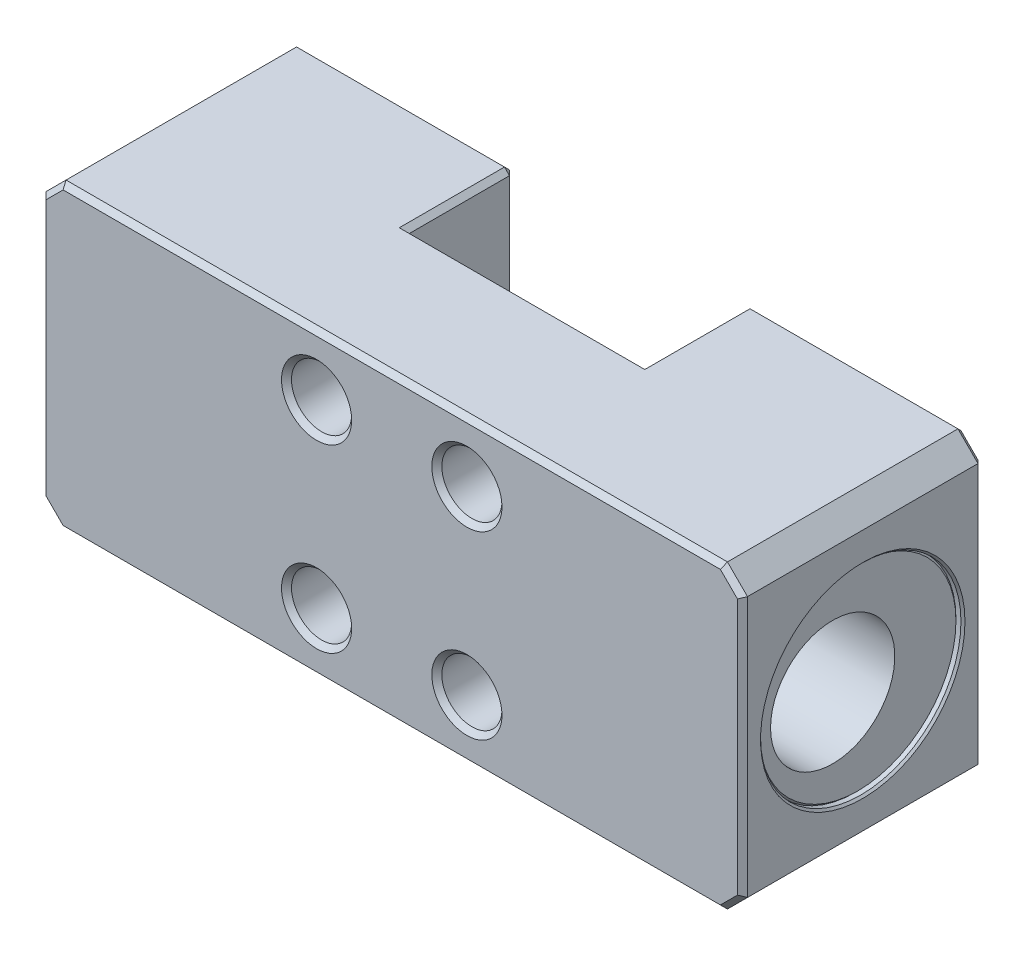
ISO-10303-21;
HEADER;
FILE_DESCRIPTION(('STEP AP214'),'2;1');
FILE_NAME('part.step','',(''),(''),'','','');
FILE_SCHEMA(('AUTOMOTIVE_DESIGN { 1 0 10303 214 1 1 1 1 }'));
ENDSEC;
DATA;
#1=APPLICATION_CONTEXT('core data for automotive mechanical design processes');
#2=APPLICATION_PROTOCOL_DEFINITION('international standard','automotive_design',2000,#1);
#3=PRODUCT_CONTEXT('',#1,'mechanical');
#4=PRODUCT('Part','Part','',(#3));
#5=PRODUCT_RELATED_PRODUCT_CATEGORY('part','',(#4));
#6=PRODUCT_DEFINITION_FORMATION('','',#4);
#7=PRODUCT_DEFINITION_CONTEXT('part definition',#1,'design');
#8=PRODUCT_DEFINITION('design','',#6,#7);
#9=PRODUCT_DEFINITION_SHAPE('','',#8);
#10=(LENGTH_UNIT() NAMED_UNIT(*) SI_UNIT(.MILLI.,.METRE.));
#11=(NAMED_UNIT(*) PLANE_ANGLE_UNIT() SI_UNIT($,.RADIAN.));
#12=(NAMED_UNIT(*) SI_UNIT($,.STERADIAN.) SOLID_ANGLE_UNIT());
#13=UNCERTAINTY_MEASURE_WITH_UNIT(LENGTH_MEASURE(1.E-05),#10,'distance_accuracy_value','');
#14=(GEOMETRIC_REPRESENTATION_CONTEXT(3) GLOBAL_UNCERTAINTY_ASSIGNED_CONTEXT((#13)) GLOBAL_UNIT_ASSIGNED_CONTEXT((#10,
#11,#12)) REPRESENTATION_CONTEXT('',''));
#15=CARTESIAN_POINT('',(0.,0.,0.));
#16=DIRECTION('',(0.,0.,1.));
#17=DIRECTION('',(1.,0.,0.));
#18=AXIS2_PLACEMENT_3D('',#15,#16,#17);
#19=CARTESIAN_POINT('',(7.5,-9.,16.));
#20=DIRECTION('',(0.,0.,-1.));
#21=DIRECTION('',(1.,0.,0.));
#22=AXIS2_PLACEMENT_3D('',#19,#20,#21);
#23=CYLINDRICAL_SURFACE('',#22,3.);
#24=CARTESIAN_POINT('',(7.5,-9.,13.));
#25=DIRECTION('',(0.,0.,1.));
#26=DIRECTION('',(-1.,0.,0.));
#27=AXIS2_PLACEMENT_3D('',#24,#25,#26);
#28=CIRCLE('',#27,3.);
#29=CARTESIAN_POINT('',(4.5,-9.,13.));
#30=VERTEX_POINT('',#29);
#31=EDGE_CURVE('E247',#30,#30,#28,.F.);
#32=ORIENTED_EDGE('',*,*,#31,.F.);
#33=EDGE_LOOP('',(#32));
#34=FACE_BOUND('',#33,.T.);
#35=CARTESIAN_POINT('',(7.5,-9.,1.5));
#36=DIRECTION('',(0.,0.,-1.));
#37=DIRECTION('',(-1.,0.,0.));
#38=AXIS2_PLACEMENT_3D('',#35,#36,#37);
#39=CIRCLE('',#38,3.);
#40=CARTESIAN_POINT('',(4.5,-9.,1.5));
#41=VERTEX_POINT('',#40);
#42=EDGE_CURVE('E9',#41,#41,#39,.F.);
#43=ORIENTED_EDGE('',*,*,#42,.F.);
#44=EDGE_LOOP('',(#43));
#45=FACE_BOUND('',#44,.T.);
#46=ADVANCED_FACE('F14',(#34,#45),#23,.F.);
#47=CARTESIAN_POINT('',(-7.5,-9.,16.));
#48=DIRECTION('',(0.,0.,-1.));
#49=DIRECTION('',(1.,0.,0.));
#50=AXIS2_PLACEMENT_3D('',#47,#48,#49);
#51=CYLINDRICAL_SURFACE('',#50,3.);
#52=CARTESIAN_POINT('',(-7.5,-9.,13.));
#53=DIRECTION('',(0.,0.,1.));
#54=DIRECTION('',(-1.,0.,0.));
#55=AXIS2_PLACEMENT_3D('',#52,#53,#54);
#56=CIRCLE('',#55,3.);
#57=CARTESIAN_POINT('',(-10.5,-9.,13.));
#58=VERTEX_POINT('',#57);
#59=EDGE_CURVE('E524',#58,#58,#56,.F.);
#60=ORIENTED_EDGE('',*,*,#59,.F.);
#61=EDGE_LOOP('',(#60));
#62=FACE_BOUND('',#61,.T.);
#63=CARTESIAN_POINT('',(-7.5,-9.,1.5));
#64=DIRECTION('',(0.,0.,-1.));
#65=DIRECTION('',(-1.,0.,0.));
#66=AXIS2_PLACEMENT_3D('',#63,#64,#65);
#67=CIRCLE('',#66,3.);
#68=CARTESIAN_POINT('',(-10.5,-9.,1.5));
#69=VERTEX_POINT('',#68);
#70=EDGE_CURVE('E23',#69,#69,#67,.F.);
#71=ORIENTED_EDGE('',*,*,#70,.F.);
#72=EDGE_LOOP('',(#71));
#73=FACE_BOUND('',#72,.T.);
#74=ADVANCED_FACE('F277',(#62,#73),#51,.F.);
#75=CARTESIAN_POINT('',(-7.5,9.,16.));
#76=DIRECTION('',(0.,0.,-1.));
#77=DIRECTION('',(1.,0.,0.));
#78=AXIS2_PLACEMENT_3D('',#75,#76,#77);
#79=CYLINDRICAL_SURFACE('',#78,3.);
#80=CARTESIAN_POINT('',(-7.5,9.,13.));
#81=DIRECTION('',(0.,0.,1.));
#82=DIRECTION('',(-1.,0.,0.));
#83=AXIS2_PLACEMENT_3D('',#80,#81,#82);
#84=CIRCLE('',#83,3.);
#85=CARTESIAN_POINT('',(-10.5,9.,13.));
#86=VERTEX_POINT('',#85);
#87=EDGE_CURVE('E514',#86,#86,#84,.F.);
#88=ORIENTED_EDGE('',*,*,#87,.F.);
#89=EDGE_LOOP('',(#88));
#90=FACE_BOUND('',#89,.T.);
#91=CARTESIAN_POINT('',(-7.5,9.,1.5));
#92=DIRECTION('',(0.,0.,-1.));
#93=DIRECTION('',(-1.,0.,0.));
#94=AXIS2_PLACEMENT_3D('',#91,#92,#93);
#95=CIRCLE('',#94,3.);
#96=CARTESIAN_POINT('',(-10.5,9.,1.5));
#97=VERTEX_POINT('',#96);
#98=EDGE_CURVE('E873',#97,#97,#95,.F.);
#99=ORIENTED_EDGE('',*,*,#98,.F.);
#100=EDGE_LOOP('',(#99));
#101=FACE_BOUND('',#100,.T.);
#102=ADVANCED_FACE('F273',(#90,#101),#79,.F.);
#103=CARTESIAN_POINT('',(7.5,9.,16.));
#104=DIRECTION('',(0.,0.,-1.));
#105=DIRECTION('',(1.,0.,0.));
#106=AXIS2_PLACEMENT_3D('',#103,#104,#105);
#107=CYLINDRICAL_SURFACE('',#106,3.);
#108=CARTESIAN_POINT('',(7.5,9.,13.));
#109=DIRECTION('',(0.,0.,1.));
#110=DIRECTION('',(-1.,0.,0.));
#111=AXIS2_PLACEMENT_3D('',#108,#109,#110);
#112=CIRCLE('',#111,3.);
#113=CARTESIAN_POINT('',(4.5,9.,13.));
#114=VERTEX_POINT('',#113);
#115=EDGE_CURVE('E517',#114,#114,#112,.F.);
#116=ORIENTED_EDGE('',*,*,#115,.F.);
#117=EDGE_LOOP('',(#116));
#118=FACE_BOUND('',#117,.T.);
#119=CARTESIAN_POINT('',(7.5,9.,1.5));
#120=DIRECTION('',(0.,0.,-1.));
#121=DIRECTION('',(-1.,0.,0.));
#122=AXIS2_PLACEMENT_3D('',#119,#120,#121);
#123=CIRCLE('',#122,3.);
#124=CARTESIAN_POINT('',(4.5,9.,1.5));
#125=VERTEX_POINT('',#124);
#126=EDGE_CURVE('E871',#125,#125,#123,.F.);
#127=ORIENTED_EDGE('',*,*,#126,.F.);
#128=EDGE_LOOP('',(#127));
#129=FACE_BOUND('',#128,.T.);
#130=ADVANCED_FACE('F276',(#118,#129),#107,.F.);
#131=CARTESIAN_POINT('',(11.2,0.,1.5));
#132=DIRECTION('',(1.,0.,0.));
#133=DIRECTION('',(0.,0.,1.));
#134=AXIS2_PLACEMENT_3D('',#131,#132,#133);
#135=CYLINDRICAL_SURFACE('',#134,10.);
#136=DIRECTION('',(1.,0.,0.));
#137=VECTOR('',#136,1.);
#138=CARTESIAN_POINT('',(11.2,-9.88685996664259,0.));
#139=LINE('',#138,#137);
#140=CARTESIAN_POINT('',(12.,-9.88685996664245,0.));
#141=VERTEX_POINT('',#140);
#142=CARTESIAN_POINT('',(11.75,-9.88685996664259,0.));
#143=VERTEX_POINT('',#142);
#144=EDGE_CURVE('E788',#141,#143,#139,.F.);
#145=ORIENTED_EDGE('',*,*,#144,.F.);
#146=CARTESIAN_POINT('',(12.,1.40127016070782E-13,1.5));
#147=DIRECTION('',(1.,0.,0.));
#148=DIRECTION('',(0.,0.,1.));
#149=AXIS2_PLACEMENT_3D('',#146,#147,#148);
#150=CIRCLE('',#149,10.);
#151=CARTESIAN_POINT('',(12.,9.88685996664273,0.));
#152=VERTEX_POINT('',#151);
#153=EDGE_CURVE('E258',#141,#152,#150,.T.);
#154=ORIENTED_EDGE('',*,*,#153,.T.);
#155=DIRECTION('',(1.,0.,0.));
#156=VECTOR('',#155,1.);
#157=CARTESIAN_POINT('',(11.2,9.88685996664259,0.));
#158=LINE('',#157,#156);
#159=CARTESIAN_POINT('',(11.75,9.88685996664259,0.));
#160=VERTEX_POINT('',#159);
#161=EDGE_CURVE('E30',#160,#152,#158,.T.);
#162=ORIENTED_EDGE('',*,*,#161,.F.);
#163=CARTESIAN_POINT('',(11.75,0.,1.5));
#164=DIRECTION('',(1.,0.,0.));
#165=DIRECTION('',(0.,0.,1.));
#166=AXIS2_PLACEMENT_3D('',#163,#164,#165);
#167=CIRCLE('',#166,10.);
#168=EDGE_CURVE('E543',#143,#160,#167,.T.);
#169=ORIENTED_EDGE('',*,*,#168,.F.);
#170=EDGE_LOOP('',(#145,#154,#162,#169));
#171=FACE_BOUND('',#170,.T.);
#172=ADVANCED_FACE('F281',(#171),#135,.F.);
#173=CARTESIAN_POINT('',(11.5,1.39796818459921E-13,1.5));
#174=DIRECTION('',(-1.,0.,0.));
#175=DIRECTION('',(0.,-1.,0.));
#176=AXIS2_PLACEMENT_3D('',#173,#174,#175);
#177=PLANE('',#176);
#178=CARTESIAN_POINT('',(11.5,1.39796818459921E-13,1.5));
#179=DIRECTION('',(-1.,0.,0.));
#180=DIRECTION('',(0.,-1.,0.));
#181=AXIS2_PLACEMENT_3D('',#178,#179,#180);
#182=CIRCLE('',#181,9.5);
#183=CARTESIAN_POINT('',(11.5,9.380831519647,0.));
#184=VERTEX_POINT('',#183);
#185=CARTESIAN_POINT('',(11.5,-9.38083151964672,0.));
#186=VERTEX_POINT('',#185);
#187=EDGE_CURVE('E237',#184,#186,#182,.T.);
#188=ORIENTED_EDGE('',*,*,#187,.T.);
#189=DIRECTION('',(0.,1.,0.));
#190=VECTOR('',#189,1.);
#191=CARTESIAN_POINT('',(11.5,1.39796818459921E-13,0.));
#192=LINE('',#191,#190);
#193=EDGE_CURVE('E225',#186,#184,#192,.T.);
#194=ORIENTED_EDGE('',*,*,#193,.T.);
#195=EDGE_LOOP('',(#188,#194));
#196=FACE_BOUND('',#195,.T.);
#197=ADVANCED_FACE('F236',(#196),#177,.T.);
#198=CARTESIAN_POINT('',(11.5,1.39796818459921E-13,1.5));
#199=DIRECTION('',(1.,0.,0.));
#200=DIRECTION('',(0.,1.,0.));
#201=AXIS2_PLACEMENT_3D('',#198,#199,#200);
#202=CONICAL_SURFACE('',#201,9.5,0.785398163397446);
#203=ORIENTED_EDGE('',*,*,#153,.F.);
#204=CARTESIAN_POINT('',(24.0039494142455,-21.9527626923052,0.));
#205=CARTESIAN_POINT('',(23.2469047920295,-21.1939387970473,0.));
#206=CARTESIAN_POINT('',(22.489938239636,-20.4350369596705,0.));
#207=CARTESIAN_POINT('',(20.9762444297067,-18.9169588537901,0.));
#208=CARTESIAN_POINT('',(20.2195171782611,-18.1577825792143,0.));
#209=CARTESIAN_POINT('',(18.70601175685,-16.6386622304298,0.));
#210=CARTESIAN_POINT('',(17.9492337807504,-15.8787179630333,0.));
#211=CARTESIAN_POINT('',(16.4362444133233,-14.3583004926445,0.));
#212=CARTESIAN_POINT('',(15.680033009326,-13.5978273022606,0.));
#213=CARTESIAN_POINT('',(14.165750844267,-12.0732565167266,0.));
#214=CARTESIAN_POINT('',(13.4076832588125,-11.3091557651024,0.));
#215=CARTESIAN_POINT('',(12.2717593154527,-10.1617847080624,0.));
#216=CARTESIAN_POINT('',(11.8933007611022,-9.77911069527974,0.));
#217=CARTESIAN_POINT('',(11.1369607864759,-9.013197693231,0.));
#218=CARTESIAN_POINT('',(10.7590793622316,-8.62995870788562,0.));
#219=CARTESIAN_POINT('',(10.0042865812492,-7.86278023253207,0.));
#220=CARTESIAN_POINT('',(9.62737494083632,-7.47884102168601,0.));
#221=CARTESIAN_POINT('',(8.87483796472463,-6.70968177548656,0.));
#222=CARTESIAN_POINT('',(8.4992126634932,-6.32446170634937,0.));
#223=CARTESIAN_POINT('',(7.93745537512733,-5.74504722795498,0.));
#224=CARTESIAN_POINT('',(7.75049440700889,-5.55165684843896,0.));
#225=CARTESIAN_POINT('',(7.37732941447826,-5.16414750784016,0.));
#226=CARTESIAN_POINT('',(7.19112538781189,-4.97002854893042,0.));
#227=CARTESIAN_POINT('',(6.81977866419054,-4.58079340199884,0.));
#228=CARTESIAN_POINT('',(6.63463592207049,-4.38567725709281,0.));
#229=CARTESIAN_POINT('',(6.265877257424,-3.99400858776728,0.));
#230=CARTESIAN_POINT('',(6.08226130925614,-3.79745608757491,0.));
#231=CARTESIAN_POINT('',(5.85018647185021,-3.54603361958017,0.));
#232=CARTESIAN_POINT('',(5.80063322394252,-3.49217365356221,0.));
#233=CARTESIAN_POINT('',(5.70172942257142,-3.38426767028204,0.));
#234=CARTESIAN_POINT('',(5.65237886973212,-3.33022165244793,0.));
#235=CARTESIAN_POINT('',(5.50466917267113,-3.16776661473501,0.));
#236=CARTESIAN_POINT('',(5.40665462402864,-3.05904345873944,0.));
#237=CARTESIAN_POINT('',(5.21177102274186,-2.84041058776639,0.));
#238=CARTESIAN_POINT('',(5.11490299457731,-2.73049995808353,0.));
#239=CARTESIAN_POINT('',(4.92286191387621,-2.50921426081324,0.));
#240=CARTESIAN_POINT('',(4.82768875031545,-2.39783928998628,0.));
#241=CARTESIAN_POINT('',(4.6579402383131,-2.19479286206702,0.));
#242=CARTESIAN_POINT('',(4.58294116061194,-2.10347667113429,0.));
#243=CARTESIAN_POINT('',(4.43513245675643,-1.91909251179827,0.));
#244=CARTESIAN_POINT('',(4.36232264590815,-1.82602469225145,0.));
#245=CARTESIAN_POINT('',(4.21983768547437,-1.63752742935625,0.));
#246=CARTESIAN_POINT('',(4.1501619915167,-1.54209840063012,0.));
#247=CARTESIAN_POINT('',(4.01550042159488,-1.34801289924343,0.));
#248=CARTESIAN_POINT('',(3.95051219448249,-1.2493580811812,0.));
#249=CARTESIAN_POINT('',(3.8280306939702,-1.0478981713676,0.));
#250=CARTESIAN_POINT('',(3.77051141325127,-0.94510920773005,0.));
#251=CARTESIAN_POINT('',(3.66726765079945,-0.733677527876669,0.));
#252=CARTESIAN_POINT('',(3.62152645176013,-0.625043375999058,0.));
#253=CARTESIAN_POINT('',(3.5571747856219,-0.426024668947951,0.));
#254=CARTESIAN_POINT('',(3.5347998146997,-0.336924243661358,0.));
#255=CARTESIAN_POINT('',(3.51281643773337,-0.201519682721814,0.));
#256=CARTESIAN_POINT('',(3.50741814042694,-0.156136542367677,0.));
#257=CARTESIAN_POINT('',(3.5007254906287,-0.0650604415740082,0.));
#258=CARTESIAN_POINT('',(3.49943094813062,-0.0193674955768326,0.));
#259=CARTESIAN_POINT('',(3.50103146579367,0.0720430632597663,0.));
#260=CARTESIAN_POINT('',(3.50393574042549,0.117760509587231,0.));
#261=CARTESIAN_POINT('',(3.51378125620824,0.208760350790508,0.));
#262=CARTESIAN_POINT('',(3.52072327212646,0.254042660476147,0.));
#263=CARTESIAN_POINT('',(3.53829975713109,0.343972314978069,0.));
#264=CARTESIAN_POINT('',(3.54894183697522,0.388618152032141,0.));
#265=CARTESIAN_POINT('',(3.57344576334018,0.477005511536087,0.));
#266=CARTESIAN_POINT('',(3.58730776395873,0.520746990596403,0.));
#267=CARTESIAN_POINT('',(3.63732767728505,0.662894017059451,0.));
#268=CARTESIAN_POINT('',(3.6792373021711,0.759275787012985,0.));
#269=CARTESIAN_POINT('',(3.77229215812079,0.947491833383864,0.));
#270=CARTESIAN_POINT('',(3.82345644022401,1.03931622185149,0.));
#271=CARTESIAN_POINT('',(3.9322234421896,1.22013759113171,0.));
#272=CARTESIAN_POINT('',(3.98987925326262,1.30910226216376,0.));
#273=CARTESIAN_POINT('',(4.07936327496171,1.44040432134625,0.));
#274=CARTESIAN_POINT('',(4.10967670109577,1.48379471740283,0.));
#275=CARTESIAN_POINT('',(4.17115053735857,1.569970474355,0.));
#276=CARTESIAN_POINT('',(4.20231091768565,1.6127558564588,0.));
#277=CARTESIAN_POINT('',(4.3032661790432,1.74900334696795,0.));
#278=CARTESIAN_POINT('',(4.37441089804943,1.84146430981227,0.));
#279=CARTESIAN_POINT('',(4.51904959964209,2.02453564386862,0.));
#280=CARTESIAN_POINT('',(4.59254392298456,2.11514574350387,0.));
#281=CARTESIAN_POINT('',(4.74125574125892,2.29500378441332,0.));
#282=CARTESIAN_POINT('',(4.81647397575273,2.3842511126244,0.));
#283=CARTESIAN_POINT('',(4.96817173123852,2.56166901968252,0.));
#284=CARTESIAN_POINT('',(5.04465129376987,2.64983956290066,0.));
#285=CARTESIAN_POINT('',(5.27576461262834,2.91338875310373,0.));
#286=CARTESIAN_POINT('',(5.43182760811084,3.08751259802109,0.));
#287=CARTESIAN_POINT('',(5.74624302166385,3.4335837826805,0.));
#288=CARTESIAN_POINT('',(5.9045948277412,3.60553168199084,0.));
#289=CARTESIAN_POINT('',(6.22210971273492,3.94717159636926,0.));
#290=CARTESIAN_POINT('',(6.38126547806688,4.11687041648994,0.));
#291=CARTESIAN_POINT('',(6.70066409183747,4.45526144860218,0.));
#292=CARTESIAN_POINT('',(6.86090701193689,4.62395359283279,0.));
#293=CARTESIAN_POINT('',(7.1820159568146,4.96042441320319,0.));
#294=CARTESIAN_POINT('',(7.34288120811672,5.12820382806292,0.));
#295=CARTESIAN_POINT('',(7.66519411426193,5.46319467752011,0.));
#296=CARTESIAN_POINT('',(7.82664175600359,5.63040612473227,0.));
#297=CARTESIAN_POINT('',(8.3175384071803,6.13747635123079,0.));
#298=CARTESIAN_POINT('',(8.64768650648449,6.47665813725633,0.));
#299=CARTESIAN_POINT('',(9.30911962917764,7.15391182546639,0.));
#300=CARTESIAN_POINT('',(9.64040465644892,7.49198372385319,0.));
#301=CARTESIAN_POINT('',(10.303742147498,8.16738463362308,0.));
#302=CARTESIAN_POINT('',(10.6357946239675,8.50471363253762,0.));
#303=CARTESIAN_POINT('',(11.3004331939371,9.17884563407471,0.));
#304=CARTESIAN_POINT('',(11.6330192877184,9.51564863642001,0.));
#305=CARTESIAN_POINT('',(12.631666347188,10.5258128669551,0.));
#306=CARTESIAN_POINT('',(13.298299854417,11.1986079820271,0.));
#307=CARTESIAN_POINT('',(14.6324282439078,12.5433326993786,0.));
#308=CARTESIAN_POINT('',(15.2999231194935,13.2152623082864,0.));
#309=CARTESIAN_POINT('',(16.6368400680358,14.5599557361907,0.));
#310=CARTESIAN_POINT('',(17.3062632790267,15.2327184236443,0.));
#311=CARTESIAN_POINT('',(18.6454814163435,16.5778771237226,0.));
#312=CARTESIAN_POINT('',(19.3152763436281,17.2502731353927,0.));
#313=CARTESIAN_POINT('',(20.6547782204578,18.5944590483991,0.));
#314=CARTESIAN_POINT('',(21.3244850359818,19.2662490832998,0.));
#315=CARTESIAN_POINT('',(22.664089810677,20.6096348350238,0.));
#316=CARTESIAN_POINT('',(23.3339877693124,21.2812305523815,0.));
#317=CARTESIAN_POINT('',(24.0039494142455,21.9527626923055,0.));
#318=B_SPLINE_CURVE_WITH_KNOTS('',3,(#204,#205,#206,#207,#208,#209,#210,#211,#212,#213,#214,
#215,#216,#217,#218,#219,#220,#221,#222,#223,#224,#225,#226,#227,#228,#229,#230,#231,#232,#233,
#234,#235,#236,#237,#238,#239,#240,#241,#242,#243,#244,#245,#246,#247,#248,#249,#250,#251,#252,
#253,#254,#255,#256,#257,#258,#259,#260,#261,#262,#263,#264,#265,#266,#267,#268,#269,#270,#271,
#272,#273,#274,#275,#276,#277,#278,#279,#280,#281,#282,#283,#284,#285,#286,#287,#288,#289,#290,
#291,#292,#293,#294,#295,#296,#297,#298,#299,#300,#301,#302,#303,#304,#305,#306,#307,#308,#309,
#310,#311,#312,#313,#314,#315,#316,#317),.UNSPECIFIED.,.F.,.F.,(4,2,2,2,2,2,2,2,2,2,2,2,2,2,2,2,
2,2,2,2,2,2,2,2,2,2,2,2,2,2,2,2,2,2,2,2,2,2,2,2,2,2,2,2,2,2,2,2,2,2,2,2,2,2,2,2,4),(0.,
3.21564498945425,6.43136611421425,9.6488266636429,12.8662129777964,16.0952433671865,
17.7098737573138,19.3244929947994,20.9385688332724,22.5526875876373,23.3596485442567,
24.1666070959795,24.9735310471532,25.7804414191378,26.0000036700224,26.2195665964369,
26.6587040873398,27.098208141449,27.5376832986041,27.8921619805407,28.2466106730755,
28.6009975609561,28.9552054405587,29.3081448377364,29.6605804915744,29.9349920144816,
30.0719372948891,30.2088762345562,30.3461161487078,30.4833824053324,30.6209326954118,
30.7584895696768,31.0729024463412,31.3879700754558,31.7058327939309,31.864618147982,
32.0233979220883,32.3733289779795,32.7233110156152,33.0734461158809,33.423592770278,
34.1250308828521,34.8262847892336,35.5242420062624,36.2222456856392,36.9195586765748,
37.6168560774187,39.0368433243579,40.4568354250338,41.8768511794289,43.2968676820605,
46.1382532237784,48.9796168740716,51.8268316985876,54.6740539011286,57.5198018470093,
60.3655418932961),.UNSPECIFIED.);
#319=EDGE_CURVE('E231',#141,#186,#318,.T.);
#320=ORIENTED_EDGE('',*,*,#319,.T.);
#321=ORIENTED_EDGE('',*,*,#187,.F.);
#322=EDGE_CURVE('E220',#184,#152,#318,.T.);
#323=ORIENTED_EDGE('',*,*,#322,.T.);
#324=EDGE_LOOP('',(#203,#320,#321,#323));
#325=FACE_BOUND('',#324,.T.);
#326=ADVANCED_FACE('F16',(#325),#202,.T.);
#327=CARTESIAN_POINT('',(-11.2,0.,1.5));
#328=DIRECTION('',(-1.,0.,0.));
#329=DIRECTION('',(0.,0.,-1.));
#330=AXIS2_PLACEMENT_3D('',#327,#328,#329);
#331=CYLINDRICAL_SURFACE('',#330,10.);
#332=DIRECTION('',(-1.,0.,0.));
#333=VECTOR('',#332,1.);
#334=CARTESIAN_POINT('',(-11.2,9.88685996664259,0.));
#335=LINE('',#334,#333);
#336=CARTESIAN_POINT('',(-12.,9.88685996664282,0.));
#337=VERTEX_POINT('',#336);
#338=CARTESIAN_POINT('',(-11.75,9.88685996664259,0.));
#339=VERTEX_POINT('',#338);
#340=EDGE_CURVE('E509',#337,#339,#335,.F.);
#341=ORIENTED_EDGE('',*,*,#340,.F.);
#342=CARTESIAN_POINT('',(-12.,2.26189846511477E-13,1.49999999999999));
#343=DIRECTION('',(1.,0.,0.));
#344=DIRECTION('',(0.,1.,0.));
#345=AXIS2_PLACEMENT_3D('',#342,#343,#344);
#346=CIRCLE('',#345,10.);
#347=CARTESIAN_POINT('',(-12.,-9.88685996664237,0.));
#348=VERTEX_POINT('',#347);
#349=EDGE_CURVE('E507',#337,#348,#346,.F.);
#350=ORIENTED_EDGE('',*,*,#349,.T.);
#351=DIRECTION('',(-1.,0.,0.));
#352=VECTOR('',#351,1.);
#353=CARTESIAN_POINT('',(-11.2,-9.88685996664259,0.));
#354=LINE('',#353,#352);
#355=CARTESIAN_POINT('',(-11.75,-9.88685996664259,0.));
#356=VERTEX_POINT('',#355);
#357=EDGE_CURVE('E37',#356,#348,#354,.T.);
#358=ORIENTED_EDGE('',*,*,#357,.F.);
#359=CARTESIAN_POINT('',(-11.75,0.,1.5));
#360=DIRECTION('',(-1.,0.,0.));
#361=DIRECTION('',(0.,0.,-1.));
#362=AXIS2_PLACEMENT_3D('',#359,#360,#361);
#363=CIRCLE('',#362,10.);
#364=EDGE_CURVE('E512',#339,#356,#363,.T.);
#365=ORIENTED_EDGE('',*,*,#364,.F.);
#366=EDGE_LOOP('',(#341,#350,#358,#365));
#367=FACE_BOUND('',#366,.T.);
#368=ADVANCED_FACE('F307',(#367),#331,.F.);
#369=CARTESIAN_POINT('',(-11.5,2.26370285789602E-13,1.49999999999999));
#370=DIRECTION('',(1.,0.,0.));
#371=DIRECTION('',(0.,1.,0.));
#372=AXIS2_PLACEMENT_3D('',#369,#370,#371);
#373=PLANE('',#372);
#374=CARTESIAN_POINT('',(-11.5,2.26370285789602E-13,1.49999999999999));
#375=DIRECTION('',(1.,0.,0.));
#376=DIRECTION('',(0.,1.,0.));
#377=AXIS2_PLACEMENT_3D('',#374,#375,#376);
#378=CIRCLE('',#377,9.5);
#379=CARTESIAN_POINT('',(-11.5,-9.38083151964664,0.));
#380=VERTEX_POINT('',#379);
#381=CARTESIAN_POINT('',(-11.5,9.38083151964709,0.));
#382=VERTEX_POINT('',#381);
#383=EDGE_CURVE('E240',#380,#382,#378,.T.);
#384=ORIENTED_EDGE('',*,*,#383,.T.);
#385=DIRECTION('',(0.,-1.,0.));
#386=VECTOR('',#385,1.);
#387=CARTESIAN_POINT('',(-11.5,2.26370285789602E-13,0.));
#388=LINE('',#387,#386);
#389=EDGE_CURVE('E503',#382,#380,#388,.T.);
#390=ORIENTED_EDGE('',*,*,#389,.T.);
#391=EDGE_LOOP('',(#384,#390));
#392=FACE_BOUND('',#391,.T.);
#393=ADVANCED_FACE('F310',(#392),#373,.T.);
#394=CARTESIAN_POINT('',(-11.5,2.26370285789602E-13,1.49999999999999));
#395=DIRECTION('',(-1.,0.,0.));
#396=DIRECTION('',(0.,-1.,0.));
#397=AXIS2_PLACEMENT_3D('',#394,#395,#396);
#398=CONICAL_SURFACE('',#397,9.5,0.785398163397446);
#399=ORIENTED_EDGE('',*,*,#349,.F.);
#400=CARTESIAN_POINT('',(-24.0039494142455,21.9527626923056,0.));
#401=CARTESIAN_POINT('',(-23.2469047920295,21.1939387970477,0.));
#402=CARTESIAN_POINT('',(-22.489938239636,20.4350369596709,0.));
#403=CARTESIAN_POINT('',(-20.9762444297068,18.9169588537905,0.));
#404=CARTESIAN_POINT('',(-20.2195171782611,18.1577825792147,0.));
#405=CARTESIAN_POINT('',(-18.70601175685,16.6386622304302,0.));
#406=CARTESIAN_POINT('',(-17.9492337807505,15.8787179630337,0.));
#407=CARTESIAN_POINT('',(-16.4362444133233,14.3583004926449,0.));
#408=CARTESIAN_POINT('',(-15.680033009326,13.597827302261,0.));
#409=CARTESIAN_POINT('',(-14.165750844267,12.073256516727,0.));
#410=CARTESIAN_POINT('',(-13.4076832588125,11.3091557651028,0.));
#411=CARTESIAN_POINT('',(-12.2717593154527,10.1617847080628,0.));
#412=CARTESIAN_POINT('',(-11.8933007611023,9.77911069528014,0.));
#413=CARTESIAN_POINT('',(-11.1369607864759,9.0131976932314,0.));
#414=CARTESIAN_POINT('',(-10.7590793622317,8.629958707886,0.));
#415=CARTESIAN_POINT('',(-10.0042865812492,7.86278023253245,0.));
#416=CARTESIAN_POINT('',(-9.62737494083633,7.47884102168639,0.));
#417=CARTESIAN_POINT('',(-8.87483796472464,6.70968177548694,0.));
#418=CARTESIAN_POINT('',(-8.49921266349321,6.32446170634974,0.));
#419=CARTESIAN_POINT('',(-7.93745537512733,5.74504722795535,0.));
#420=CARTESIAN_POINT('',(-7.7504944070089,5.55165684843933,0.));
#421=CARTESIAN_POINT('',(-7.37732941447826,5.16414750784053,0.));
#422=CARTESIAN_POINT('',(-7.19112538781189,4.97002854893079,0.));
#423=CARTESIAN_POINT('',(-6.81977866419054,4.58079340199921,0.));
#424=CARTESIAN_POINT('',(-6.63463592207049,4.38567725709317,0.));
#425=CARTESIAN_POINT('',(-6.26587725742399,3.99400858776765,0.));
#426=CARTESIAN_POINT('',(-6.08226130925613,3.79745608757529,0.));
#427=CARTESIAN_POINT('',(-5.8501864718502,3.54603361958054,0.));
#428=CARTESIAN_POINT('',(-5.80063322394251,3.49217365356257,0.));
#429=CARTESIAN_POINT('',(-5.70172942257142,3.38426767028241,0.));
#430=CARTESIAN_POINT('',(-5.65237886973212,3.3302216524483,0.));
#431=CARTESIAN_POINT('',(-5.50466917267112,3.16776661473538,0.));
#432=CARTESIAN_POINT('',(-5.40665462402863,3.0590434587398,0.));
#433=CARTESIAN_POINT('',(-5.21177102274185,2.84041058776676,0.));
#434=CARTESIAN_POINT('',(-5.1149029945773,2.73049995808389,0.));
#435=CARTESIAN_POINT('',(-4.9228619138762,2.5092142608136,0.));
#436=CARTESIAN_POINT('',(-4.82768875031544,2.39783928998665,0.));
#437=CARTESIAN_POINT('',(-4.65794023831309,2.19479286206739,0.));
#438=CARTESIAN_POINT('',(-4.58294116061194,2.10347667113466,0.));
#439=CARTESIAN_POINT('',(-4.43513245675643,1.91909251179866,0.));
#440=CARTESIAN_POINT('',(-4.36232264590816,1.82602469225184,0.));
#441=CARTESIAN_POINT('',(-4.21983768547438,1.63752742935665,0.));
#442=CARTESIAN_POINT('',(-4.15016199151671,1.54209840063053,0.));
#443=CARTESIAN_POINT('',(-4.0155004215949,1.34801289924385,0.));
#444=CARTESIAN_POINT('',(-3.95051219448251,1.24935808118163,0.));
#445=CARTESIAN_POINT('',(-3.82803069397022,1.04789817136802,0.));
#446=CARTESIAN_POINT('',(-3.77051141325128,0.945109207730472,0.));
#447=CARTESIAN_POINT('',(-3.66726765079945,0.733677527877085,0.));
#448=CARTESIAN_POINT('',(-3.62152645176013,0.62504337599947,0.));
#449=CARTESIAN_POINT('',(-3.55717478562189,0.426024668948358,0.));
#450=CARTESIAN_POINT('',(-3.53479981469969,0.336924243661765,0.));
#451=CARTESIAN_POINT('',(-3.51281643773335,0.201519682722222,0.));
#452=CARTESIAN_POINT('',(-3.50741814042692,0.156136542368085,0.));
#453=CARTESIAN_POINT('',(-3.50072549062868,0.0650604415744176,0.));
#454=CARTESIAN_POINT('',(-3.4994309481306,0.0193674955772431,0.));
#455=CARTESIAN_POINT('',(-3.50103146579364,-0.0720430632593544,0.));
#456=CARTESIAN_POINT('',(-3.50393574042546,-0.117760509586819,0.));
#457=CARTESIAN_POINT('',(-3.51378125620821,-0.208760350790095,0.));
#458=CARTESIAN_POINT('',(-3.52072327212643,-0.254042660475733,0.));
#459=CARTESIAN_POINT('',(-3.53829975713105,-0.343972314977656,0.));
#460=CARTESIAN_POINT('',(-3.54894183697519,-0.38861815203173,0.));
#461=CARTESIAN_POINT('',(-3.57344576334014,-0.477005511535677,0.));
#462=CARTESIAN_POINT('',(-3.58730776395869,-0.520746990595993,0.));
#463=CARTESIAN_POINT('',(-3.637327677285,-0.662894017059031,0.));
#464=CARTESIAN_POINT('',(-3.67923730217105,-0.759275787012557,0.));
#465=CARTESIAN_POINT('',(-3.77229215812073,-0.947491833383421,0.));
#466=CARTESIAN_POINT('',(-3.82345644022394,-1.03931622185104,0.));
#467=CARTESIAN_POINT('',(-3.93222344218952,-1.22013759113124,0.));
#468=CARTESIAN_POINT('',(-3.98987925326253,-1.30910226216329,0.));
#469=CARTESIAN_POINT('',(-4.07936327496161,-1.44040432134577,0.));
#470=CARTESIAN_POINT('',(-4.10967670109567,-1.48379471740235,0.));
#471=CARTESIAN_POINT('',(-4.17115053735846,-1.56997047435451,0.));
#472=CARTESIAN_POINT('',(-4.20231091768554,-1.61275585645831,0.));
#473=CARTESIAN_POINT('',(-4.30326617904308,-1.74900334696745,0.));
#474=CARTESIAN_POINT('',(-4.3744108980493,-1.84146430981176,0.));
#475=CARTESIAN_POINT('',(-4.51904959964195,-2.02453564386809,0.));
#476=CARTESIAN_POINT('',(-4.59254392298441,-2.11514574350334,0.));
#477=CARTESIAN_POINT('',(-4.74125574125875,-2.29500378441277,0.));
#478=CARTESIAN_POINT('',(-4.81647397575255,-2.38425111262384,0.));
#479=CARTESIAN_POINT('',(-4.96817173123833,-2.56166901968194,0.));
#480=CARTESIAN_POINT('',(-5.04465129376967,-2.64983956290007,0.));
#481=CARTESIAN_POINT('',(-5.27576461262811,-2.91338875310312,0.));
#482=CARTESIAN_POINT('',(-5.43182760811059,-3.08751259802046,0.));
#483=CARTESIAN_POINT('',(-5.74624302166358,-3.43358378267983,0.));
#484=CARTESIAN_POINT('',(-5.9045948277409,-3.60553168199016,0.));
#485=CARTESIAN_POINT('',(-6.22210971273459,-3.94717159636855,0.));
#486=CARTESIAN_POINT('',(-6.38126547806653,-4.11687041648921,0.));
#487=CARTESIAN_POINT('',(-6.70066409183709,-4.45526144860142,0.));
#488=CARTESIAN_POINT('',(-6.8609070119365,-4.62395359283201,0.));
#489=CARTESIAN_POINT('',(-7.18201595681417,-4.96042441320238,0.));
#490=CARTESIAN_POINT('',(-7.34288120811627,-5.12820382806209,0.));
#491=CARTESIAN_POINT('',(-7.66519411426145,-5.46319467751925,0.));
#492=CARTESIAN_POINT('',(-7.8266417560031,-5.63040612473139,0.));
#493=CARTESIAN_POINT('',(-8.3175384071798,-6.13747635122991,0.));
#494=CARTESIAN_POINT('',(-8.647686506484,-6.47665813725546,0.));
#495=CARTESIAN_POINT('',(-9.30911962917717,-7.15391182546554,0.));
#496=CARTESIAN_POINT('',(-9.64040465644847,-7.49198372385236,0.));
#497=CARTESIAN_POINT('',(-10.3037421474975,-8.16738463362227,0.));
#498=CARTESIAN_POINT('',(-10.6357946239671,-8.50471363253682,0.));
#499=CARTESIAN_POINT('',(-11.3004331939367,-9.17884563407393,0.));
#500=CARTESIAN_POINT('',(-11.633019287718,-9.51564863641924,0.));
#501=CARTESIAN_POINT('',(-12.6316663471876,-10.5258128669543,0.));
#502=CARTESIAN_POINT('',(-13.2982998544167,-11.1986079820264,0.));
#503=CARTESIAN_POINT('',(-14.6324282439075,-12.5433326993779,0.));
#504=CARTESIAN_POINT('',(-15.2999231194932,-13.2152623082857,0.));
#505=CARTESIAN_POINT('',(-16.6368400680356,-14.5599557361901,0.));
#506=CARTESIAN_POINT('',(-17.3062632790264,-15.2327184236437,0.));
#507=CARTESIAN_POINT('',(-18.6454814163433,-16.5778771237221,0.));
#508=CARTESIAN_POINT('',(-19.315276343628,-17.2502731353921,0.));
#509=CARTESIAN_POINT('',(-20.6547782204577,-18.5944590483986,0.));
#510=CARTESIAN_POINT('',(-21.3244850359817,-19.2662490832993,0.));
#511=CARTESIAN_POINT('',(-22.6640898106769,-20.6096348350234,0.));
#512=CARTESIAN_POINT('',(-23.3339877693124,-21.281230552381,0.));
#513=CARTESIAN_POINT('',(-24.0039494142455,-21.9527626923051,0.));
#514=B_SPLINE_CURVE_WITH_KNOTS('',3,(#400,#401,#402,#403,#404,#405,#406,#407,#408,#409,#410,
#411,#412,#413,#414,#415,#416,#417,#418,#419,#420,#421,#422,#423,#424,#425,#426,#427,#428,#429,
#430,#431,#432,#433,#434,#435,#436,#437,#438,#439,#440,#441,#442,#443,#444,#445,#446,#447,#448,
#449,#450,#451,#452,#453,#454,#455,#456,#457,#458,#459,#460,#461,#462,#463,#464,#465,#466,#467,
#468,#469,#470,#471,#472,#473,#474,#475,#476,#477,#478,#479,#480,#481,#482,#483,#484,#485,#486,
#487,#488,#489,#490,#491,#492,#493,#494,#495,#496,#497,#498,#499,#500,#501,#502,#503,#504,#505,
#506,#507,#508,#509,#510,#511,#512,#513),.UNSPECIFIED.,.F.,.F.,(4,2,2,2,2,2,2,2,2,2,2,2,2,2,2,2,
2,2,2,2,2,2,2,2,2,2,2,2,2,2,2,2,2,2,2,2,2,2,2,2,2,2,2,2,2,2,2,2,2,2,2,2,2,2,2,2,4),(0.,
3.21564498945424,6.43136611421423,9.64882666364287,12.8662129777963,16.0952433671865,
17.7098737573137,19.3244929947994,20.9385688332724,22.5526875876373,23.3596485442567,
24.1666070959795,24.9735310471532,25.7804414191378,26.0000036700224,26.2195665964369,
26.6587040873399,27.098208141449,27.5376832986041,27.8921619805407,28.2466106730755,
28.600997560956,28.9552054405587,29.3081448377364,29.6605804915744,29.9349920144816,
30.071937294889,30.2088762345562,30.3461161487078,30.4833824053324,30.6209326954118,
30.7584895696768,31.0729024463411,31.3879700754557,31.7058327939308,31.8646181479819,
32.0233979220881,32.3733289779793,32.723311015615,33.0734461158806,33.4235927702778,
34.1250308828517,34.8262847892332,35.5242420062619,36.2222456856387,36.9195586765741,
37.616856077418,39.0368433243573,40.4568354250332,41.8768511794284,43.2968676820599,
46.138253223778,48.9796168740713,51.8268316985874,54.6740539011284,57.5198018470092,
60.3655418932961),.UNSPECIFIED.);
#515=EDGE_CURVE('E232',#337,#382,#514,.T.);
#516=ORIENTED_EDGE('',*,*,#515,.T.);
#517=ORIENTED_EDGE('',*,*,#383,.F.);
#518=EDGE_CURVE('E251',#380,#348,#514,.T.);
#519=ORIENTED_EDGE('',*,*,#518,.T.);
#520=EDGE_LOOP('',(#399,#516,#517,#519));
#521=FACE_BOUND('',#520,.T.);
#522=ADVANCED_FACE('F265',(#521),#398,.T.);
#523=CARTESIAN_POINT('',(-48.6464466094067,-1.35355339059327,-10.5));
#524=DIRECTION('',(0.5,-0.5,0.707106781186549));
#525=DIRECTION('',(0.,-0.816496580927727,-0.577350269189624));
#526=AXIS2_PLACEMENT_3D('',#523,#524,#525);
#527=PLANE('',#526);
#528=DIRECTION('',(-0.678598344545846,0.281084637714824,0.678598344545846));
#529=VECTOR('',#528,1.);
#530=CARTESIAN_POINT('',(-38.316034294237,14.3735463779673,-6.68396570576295));
#531=LINE('',#530,#529);
#532=CARTESIAN_POINT('',(-34.5,12.7928932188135,-10.5));
#533=VERTEX_POINT('',#532);
#534=CARTESIAN_POINT('',(-35.,13.,-10.));
#535=VERTEX_POINT('',#534);
#536=EDGE_CURVE('E773',#533,#535,#531,.T.);
#537=ORIENTED_EDGE('',*,*,#536,.T.);
#538=DIRECTION('',(0.707106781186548,0.707106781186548,0.));
#539=VECTOR('',#538,1.);
#540=CARTESIAN_POINT('',(-35.,13.,-10.));
#541=LINE('',#540,#539);
#542=CARTESIAN_POINT('',(-33.,15.,-10.));
#543=VERTEX_POINT('',#542);
#544=EDGE_CURVE('E610',#543,#535,#541,.F.);
#545=ORIENTED_EDGE('',*,*,#544,.F.);
#546=DIRECTION('',(-0.281084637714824,0.678598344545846,0.678598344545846));
#547=VECTOR('',#546,1.);
#548=CARTESIAN_POINT('',(-32.967273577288,14.9209914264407,-10.0790085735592));
#549=LINE('',#548,#547);
#550=CARTESIAN_POINT('',(-32.7928932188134,14.5,-10.5));
#551=VERTEX_POINT('',#550);
#552=EDGE_CURVE('E767',#551,#543,#549,.T.);
#553=ORIENTED_EDGE('',*,*,#552,.F.);
#554=DIRECTION('',(0.707106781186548,0.707106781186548,0.));
#555=VECTOR('',#554,1.);
#556=CARTESIAN_POINT('',(-32.6464466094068,14.6464466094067,-10.5));
#557=LINE('',#556,#555);
#558=EDGE_CURVE('E667',#533,#551,#557,.T.);
#559=ORIENTED_EDGE('',*,*,#558,.F.);
#560=EDGE_LOOP('',(#537,#545,#553,#559));
#561=FACE_BOUND('',#560,.T.);
#562=ADVANCED_FACE('F401',(#561),#527,.F.);
#563=CARTESIAN_POINT('',(-48.6464466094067,-1.35355339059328,13.5));
#564=DIRECTION('',(0.5,-0.5,-0.70710678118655));
#565=DIRECTION('',(0.816496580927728,0.,0.577350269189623));
#566=AXIS2_PLACEMENT_3D('',#563,#564,#565);
#567=PLANE('',#566);
#568=DIRECTION('',(-0.678598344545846,0.281084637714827,-0.678598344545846));
#569=VECTOR('',#568,1.);
#570=CARTESIAN_POINT('',(-29.6591800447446,10.7877599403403,18.3408199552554));
#571=LINE('',#570,#569);
#572=CARTESIAN_POINT('',(-35.,13.,13.));
#573=VERTEX_POINT('',#572);
#574=CARTESIAN_POINT('',(-34.5,12.7928932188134,13.5));
#575=VERTEX_POINT('',#574);
#576=EDGE_CURVE('E700',#573,#575,#571,.F.);
#577=ORIENTED_EDGE('',*,*,#576,.T.);
#578=DIRECTION('',(-0.707106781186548,-0.707106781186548,0.));
#579=VECTOR('',#578,1.);
#580=CARTESIAN_POINT('',(-34.6464466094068,12.6464466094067,13.5));
#581=LINE('',#580,#579);
#582=CARTESIAN_POINT('',(-32.7928932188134,14.5,13.5));
#583=VERTEX_POINT('',#582);
#584=EDGE_CURVE('E586',#583,#575,#581,.T.);
#585=ORIENTED_EDGE('',*,*,#584,.F.);
#586=DIRECTION('',(-0.281084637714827,0.678598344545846,-0.678598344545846));
#587=VECTOR('',#586,1.);
#588=CARTESIAN_POINT('',(-31.0214964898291,10.2234699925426,17.7765300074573));
#589=LINE('',#588,#587);
#590=CARTESIAN_POINT('',(-33.,15.,13.));
#591=VERTEX_POINT('',#590);
#592=EDGE_CURVE('E694',#591,#583,#589,.F.);
#593=ORIENTED_EDGE('',*,*,#592,.F.);
#594=DIRECTION('',(-0.707106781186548,-0.707106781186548,0.));
#595=VECTOR('',#594,1.);
#596=CARTESIAN_POINT('',(-33.,15.,13.));
#597=LINE('',#596,#595);
#598=EDGE_CURVE('E612',#573,#591,#597,.F.);
#599=ORIENTED_EDGE('',*,*,#598,.F.);
#600=EDGE_LOOP('',(#577,#585,#593,#599));
#601=FACE_BOUND('',#600,.T.);
#602=ADVANCED_FACE('F333',(#601),#567,.F.);
#603=CARTESIAN_POINT('',(-35.,-15.,13.5));
#604=DIRECTION('',(0.,0.,-1.));
#605=DIRECTION('',(1.,0.,0.));
#606=AXIS2_PLACEMENT_3D('',#603,#604,#605);
#607=PLANE('',#606);
#608=DIRECTION('',(0.,1.,0.));
#609=VECTOR('',#608,1.);
#610=CARTESIAN_POINT('',(34.5,-15.,13.5));
#611=LINE('',#610,#609);
#612=CARTESIAN_POINT('',(34.5,-12.7928932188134,13.5));
#613=VERTEX_POINT('',#612);
#614=CARTESIAN_POINT('',(34.5,12.7928932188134,13.5));
#615=VERTEX_POINT('',#614);
#616=EDGE_CURVE('E584',#613,#615,#611,.T.);
#617=ORIENTED_EDGE('',*,*,#616,.T.);
#618=DIRECTION('',(-0.707106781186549,0.707106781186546,0.));
#619=VECTOR('',#618,1.);
#620=CARTESIAN_POINT('',(32.6464466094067,14.6464466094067,13.5));
#621=LINE('',#620,#619);
#622=CARTESIAN_POINT('',(32.7928932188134,14.5,13.5));
#623=VERTEX_POINT('',#622);
#624=EDGE_CURVE('E590',#615,#623,#621,.T.);
#625=ORIENTED_EDGE('',*,*,#624,.T.);
#626=DIRECTION('',(-1.,0.,0.));
#627=VECTOR('',#626,1.);
#628=CARTESIAN_POINT('',(-35.,14.5,13.5));
#629=LINE('',#628,#627);
#630=EDGE_CURVE('E588',#623,#583,#629,.T.);
#631=ORIENTED_EDGE('',*,*,#630,.T.);
#632=ORIENTED_EDGE('',*,*,#584,.T.);
#633=DIRECTION('',(0.,-1.,0.));
#634=VECTOR('',#633,1.);
#635=CARTESIAN_POINT('',(-34.5,-15.,13.5));
#636=LINE('',#635,#634);
#637=CARTESIAN_POINT('',(-34.5,-12.7928932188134,13.5));
#638=VERTEX_POINT('',#637);
#639=EDGE_CURVE('E580',#575,#638,#636,.T.);
#640=ORIENTED_EDGE('',*,*,#639,.T.);
#641=DIRECTION('',(0.707106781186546,-0.707106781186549,0.));
#642=VECTOR('',#641,1.);
#643=CARTESIAN_POINT('',(-32.6464466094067,-14.6464466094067,13.5));
#644=LINE('',#643,#642);
#645=CARTESIAN_POINT('',(-32.7928932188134,-14.5,13.5));
#646=VERTEX_POINT('',#645);
#647=EDGE_CURVE('E578',#638,#646,#644,.T.);
#648=ORIENTED_EDGE('',*,*,#647,.T.);
#649=DIRECTION('',(1.,0.,0.));
#650=VECTOR('',#649,1.);
#651=CARTESIAN_POINT('',(33.,-14.5,13.5));
#652=LINE('',#651,#650);
#653=CARTESIAN_POINT('',(32.7928932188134,-14.5,13.5));
#654=VERTEX_POINT('',#653);
#655=EDGE_CURVE('E576',#646,#654,#652,.T.);
#656=ORIENTED_EDGE('',*,*,#655,.T.);
#657=DIRECTION('',(0.707106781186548,0.707106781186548,0.));
#658=VECTOR('',#657,1.);
#659=CARTESIAN_POINT('',(34.6464466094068,-12.6464466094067,13.5));
#660=LINE('',#659,#658);
#661=EDGE_CURVE('E582',#654,#613,#660,.T.);
#662=ORIENTED_EDGE('',*,*,#661,.T.);
#663=EDGE_LOOP('',(#617,#625,#631,#632,#640,#648,#656,#662));
#664=FACE_BOUND('',#663,.T.);
#665=CARTESIAN_POINT('',(-7.5,9.,13.5));
#666=DIRECTION('',(0.,0.,1.));
#667=DIRECTION('',(0.,-1.,0.));
#668=AXIS2_PLACEMENT_3D('',#665,#666,#667);
#669=CIRCLE('',#668,3.5);
#670=CARTESIAN_POINT('',(-7.5,5.5,13.5));
#671=VERTEX_POINT('',#670);
#672=EDGE_CURVE('E529',#671,#671,#669,.T.);
#673=ORIENTED_EDGE('',*,*,#672,.F.);
#674=EDGE_LOOP('',(#673));
#675=FACE_BOUND('',#674,.T.);
#676=CARTESIAN_POINT('',(7.5,9.,13.5));
#677=DIRECTION('',(0.,0.,1.));
#678=DIRECTION('',(0.,-1.,0.));
#679=AXIS2_PLACEMENT_3D('',#676,#677,#678);
#680=CIRCLE('',#679,3.5);
#681=CARTESIAN_POINT('',(7.5,5.5,13.5));
#682=VERTEX_POINT('',#681);
#683=EDGE_CURVE('E532',#682,#682,#680,.T.);
#684=ORIENTED_EDGE('',*,*,#683,.F.);
#685=EDGE_LOOP('',(#684));
#686=FACE_BOUND('',#685,.T.);
#687=CARTESIAN_POINT('',(7.5,-9.,13.5));
#688=DIRECTION('',(0.,0.,1.));
#689=DIRECTION('',(0.,-1.,0.));
#690=AXIS2_PLACEMENT_3D('',#687,#688,#689);
#691=CIRCLE('',#690,3.5);
#692=CARTESIAN_POINT('',(7.5,-12.5,13.5));
#693=VERTEX_POINT('',#692);
#694=EDGE_CURVE('E536',#693,#693,#691,.T.);
#695=ORIENTED_EDGE('',*,*,#694,.F.);
#696=EDGE_LOOP('',(#695));
#697=FACE_BOUND('',#696,.T.);
#698=CARTESIAN_POINT('',(-7.5,-9.,13.5));
#699=DIRECTION('',(0.,0.,1.));
#700=DIRECTION('',(0.,-1.,0.));
#701=AXIS2_PLACEMENT_3D('',#698,#699,#700);
#702=CIRCLE('',#701,3.5);
#703=CARTESIAN_POINT('',(-7.5,-12.5,13.5));
#704=VERTEX_POINT('',#703);
#705=EDGE_CURVE('E539',#704,#704,#702,.T.);
#706=ORIENTED_EDGE('',*,*,#705,.F.);
#707=EDGE_LOOP('',(#706));
#708=FACE_BOUND('',#707,.T.);
#709=ADVANCED_FACE('F329',(#664,#675,#686,#697,#708),#607,.F.);
#710=CARTESIAN_POINT('',(-33.6464466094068,-13.6464466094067,-10.5));
#711=DIRECTION('',(-0.5,-0.5,-0.707106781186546));
#712=DIRECTION('',(0.816496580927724,0.,-0.577350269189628));
#713=AXIS2_PLACEMENT_3D('',#710,#711,#712);
#714=PLANE('',#713);
#715=DIRECTION('',(0.678598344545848,0.281084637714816,-0.678598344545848));
#716=VECTOR('',#715,1.);
#717=CARTESIAN_POINT('',(-34.9209914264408,-12.967273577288,-10.0790085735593));
#718=LINE('',#717,#716);
#719=CARTESIAN_POINT('',(-35.,-13.,-10.));
#720=VERTEX_POINT('',#719);
#721=CARTESIAN_POINT('',(-34.5,-12.7928932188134,-10.5));
#722=VERTEX_POINT('',#721);
#723=EDGE_CURVE('E692',#720,#722,#718,.T.);
#724=ORIENTED_EDGE('',*,*,#723,.T.);
#725=DIRECTION('',(-0.707106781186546,0.707106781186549,0.));
#726=VECTOR('',#725,1.);
#727=CARTESIAN_POINT('',(-34.6464466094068,-12.6464466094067,-10.5));
#728=LINE('',#727,#726);
#729=CARTESIAN_POINT('',(-32.7928932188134,-14.5,-10.5));
#730=VERTEX_POINT('',#729);
#731=EDGE_CURVE('E673',#730,#722,#728,.T.);
#732=ORIENTED_EDGE('',*,*,#731,.F.);
#733=DIRECTION('',(0.281084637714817,0.678598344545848,-0.678598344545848));
#734=VECTOR('',#733,1.);
#735=CARTESIAN_POINT('',(-33.1580171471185,-15.3814871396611,-9.6185128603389));
#736=LINE('',#735,#734);
#737=CARTESIAN_POINT('',(-33.,-15.,-10.));
#738=VERTEX_POINT('',#737);
#739=EDGE_CURVE('E770',#738,#730,#736,.T.);
#740=ORIENTED_EDGE('',*,*,#739,.F.);
#741=DIRECTION('',(0.707106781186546,-0.707106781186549,0.));
#742=VECTOR('',#741,1.);
#743=CARTESIAN_POINT('',(-33.,-15.,-10.));
#744=LINE('',#743,#742);
#745=EDGE_CURVE('E626',#720,#738,#744,.T.);
#746=ORIENTED_EDGE('',*,*,#745,.F.);
#747=EDGE_LOOP('',(#724,#732,#740,#746));
#748=FACE_BOUND('',#747,.T.);
#749=ADVANCED_FACE('F332',(#748),#714,.T.);
#750=CARTESIAN_POINT('',(-33.6464466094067,-13.6464466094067,13.5));
#751=DIRECTION('',(-0.5,-0.5,0.707106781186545));
#752=DIRECTION('',(-0.816496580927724,0.,-0.577350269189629));
#753=AXIS2_PLACEMENT_3D('',#750,#751,#752);
#754=PLANE('',#753);
#755=DIRECTION('',(0.678598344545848,0.281084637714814,0.678598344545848));
#756=VECTOR('',#755,1.);
#757=CARTESIAN_POINT('',(-34.2697521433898,-12.6975214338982,13.7302478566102));
#758=LINE('',#757,#756);
#759=CARTESIAN_POINT('',(-35.,-13.,13.));
#760=VERTEX_POINT('',#759);
#761=EDGE_CURVE('E706',#760,#638,#758,.T.);
#762=ORIENTED_EDGE('',*,*,#761,.F.);
#763=DIRECTION('',(-0.707106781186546,0.707106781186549,0.));
#764=VECTOR('',#763,1.);
#765=CARTESIAN_POINT('',(-35.,-13.,13.));
#766=LINE('',#765,#764);
#767=CARTESIAN_POINT('',(-33.,-15.,13.));
#768=VERTEX_POINT('',#767);
#769=EDGE_CURVE('E628',#768,#760,#766,.T.);
#770=ORIENTED_EDGE('',*,*,#769,.F.);
#771=DIRECTION('',(-0.281084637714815,-0.678598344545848,-0.678598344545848));
#772=VECTOR('',#771,1.);
#773=CARTESIAN_POINT('',(-33.1580171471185,-15.3814871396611,12.6185128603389));
#774=LINE('',#773,#772);
#775=EDGE_CURVE('E533',#646,#768,#774,.T.);
#776=ORIENTED_EDGE('',*,*,#775,.F.);
#777=ORIENTED_EDGE('',*,*,#647,.F.);
#778=EDGE_LOOP('',(#762,#770,#776,#777));
#779=FACE_BOUND('',#778,.T.);
#780=ADVANCED_FACE('F405',(#779),#754,.T.);
#781=CARTESIAN_POINT('',(-1.35355339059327,-48.6464466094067,13.5));
#782=DIRECTION('',(0.5,-0.5,0.707106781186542));
#783=DIRECTION('',(0.,-0.816496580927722,-0.577350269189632));
#784=AXIS2_PLACEMENT_3D('',#781,#782,#783);
#785=PLANE('',#784);
#786=DIRECTION('',(-0.281084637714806,0.67859834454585,0.67859834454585));
#787=VECTOR('',#786,1.);
#788=CARTESIAN_POINT('',(27.6274169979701,-2.02943725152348,25.9705627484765));
#789=LINE('',#788,#787);
#790=CARTESIAN_POINT('',(33.,-15.,13.));
#791=VERTEX_POINT('',#790);
#792=EDGE_CURVE('E703',#654,#791,#789,.F.);
#793=ORIENTED_EDGE('',*,*,#792,.T.);
#794=DIRECTION('',(-0.707106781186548,-0.707106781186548,0.));
#795=VECTOR('',#794,1.);
#796=CARTESIAN_POINT('',(33.,-15.,13.));
#797=LINE('',#796,#795);
#798=CARTESIAN_POINT('',(35.,-13.,13.));
#799=VERTEX_POINT('',#798);
#800=EDGE_CURVE('E620',#799,#791,#797,.T.);
#801=ORIENTED_EDGE('',*,*,#800,.F.);
#802=DIRECTION('',(0.678598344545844,-0.281084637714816,-0.678598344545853));
#803=VECTOR('',#802,1.);
#804=CARTESIAN_POINT('',(24.8284271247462,-8.78679656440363,23.1715728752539));
#805=LINE('',#804,#803);
#806=EDGE_CURVE('E697',#613,#799,#805,.T.);
#807=ORIENTED_EDGE('',*,*,#806,.F.);
#808=ORIENTED_EDGE('',*,*,#661,.F.);
#809=EDGE_LOOP('',(#793,#801,#807,#808));
#810=FACE_BOUND('',#809,.T.);
#811=ADVANCED_FACE('F388',(#810),#785,.T.);
#812=CARTESIAN_POINT('',(13.6464466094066,33.6464466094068,13.5));
#813=DIRECTION('',(-0.5,-0.5,-0.707106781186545));
#814=DIRECTION('',(0.,0.816496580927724,-0.577350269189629));
#815=AXIS2_PLACEMENT_3D('',#812,#813,#814);
#816=PLANE('',#815);
#817=DIRECTION('',(-0.678598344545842,-0.281084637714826,0.67859834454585));
#818=VECTOR('',#817,1.);
#819=CARTESIAN_POINT('',(29.1986843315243,10.5970163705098,18.8013156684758));
#820=LINE('',#819,#818);
#821=CARTESIAN_POINT('',(35.,13.,13.));
#822=VERTEX_POINT('',#821);
#823=EDGE_CURVE('E691',#615,#822,#820,.F.);
#824=ORIENTED_EDGE('',*,*,#823,.T.);
#825=DIRECTION('',(-0.707106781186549,0.707106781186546,0.));
#826=VECTOR('',#825,1.);
#827=CARTESIAN_POINT('',(35.,13.,13.));
#828=LINE('',#827,#826);
#829=CARTESIAN_POINT('',(33.,15.,13.));
#830=VERTEX_POINT('',#829);
#831=EDGE_CURVE('E595',#830,#822,#828,.F.);
#832=ORIENTED_EDGE('',*,*,#831,.F.);
#833=DIRECTION('',(0.281084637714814,0.678598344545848,-0.678598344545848));
#834=VECTOR('',#833,1.);
#835=CARTESIAN_POINT('',(27.4366734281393,1.56894153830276,26.4310584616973));
#836=LINE('',#835,#834);
#837=EDGE_CURVE('E689',#830,#623,#836,.F.);
#838=ORIENTED_EDGE('',*,*,#837,.T.);
#839=ORIENTED_EDGE('',*,*,#624,.F.);
#840=EDGE_LOOP('',(#824,#832,#838,#839));
#841=FACE_BOUND('',#840,.T.);
#842=ADVANCED_FACE('F384',(#841),#816,.F.);
#843=CARTESIAN_POINT('',(-35.,14.5,-10.5));
#844=DIRECTION('',(0.,-0.707106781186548,0.707106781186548));
#845=DIRECTION('',(0.,-0.707106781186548,-0.707106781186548));
#846=AXIS2_PLACEMENT_3D('',#843,#844,#845);
#847=PLANE('',#846);
#848=ORIENTED_EDGE('',*,*,#552,.T.);
#849=DIRECTION('',(-1.,0.,0.));
#850=VECTOR('',#849,1.);
#851=CARTESIAN_POINT('',(-35.,15.,-10.));
#852=LINE('',#851,#850);
#853=CARTESIAN_POINT('',(-12.25,15.,-10.));
#854=VERTEX_POINT('',#853);
#855=EDGE_CURVE('E604',#854,#543,#852,.T.);
#856=ORIENTED_EDGE('',*,*,#855,.F.);
#857=DIRECTION('',(0.,-0.707106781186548,-0.707106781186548));
#858=VECTOR('',#857,1.);
#859=CARTESIAN_POINT('',(-12.25,14.5,-10.5));
#860=LINE('',#859,#858);
#861=CARTESIAN_POINT('',(-12.25,14.5,-10.5));
#862=VERTEX_POINT('',#861);
#863=EDGE_CURVE('E758',#862,#854,#860,.F.);
#864=ORIENTED_EDGE('',*,*,#863,.F.);
#865=DIRECTION('',(1.,0.,0.));
#866=VECTOR('',#865,1.);
#867=CARTESIAN_POINT('',(-35.,14.5,-10.5));
#868=LINE('',#867,#866);
#869=EDGE_CURVE('E665',#551,#862,#868,.T.);
#870=ORIENTED_EDGE('',*,*,#869,.F.);
#871=EDGE_LOOP('',(#848,#856,#864,#870));
#872=FACE_BOUND('',#871,.T.);
#873=ADVANCED_FACE('F387',(#872),#847,.F.);
#874=CARTESIAN_POINT('',(-35.,14.5,13.5));
#875=DIRECTION('',(0.,-0.707106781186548,-0.707106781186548));
#876=DIRECTION('',(0.,0.707106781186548,-0.707106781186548));
#877=AXIS2_PLACEMENT_3D('',#874,#875,#876);
#878=PLANE('',#877);
#879=ORIENTED_EDGE('',*,*,#592,.T.);
#880=ORIENTED_EDGE('',*,*,#630,.F.);
#881=ORIENTED_EDGE('',*,*,#837,.F.);
#882=DIRECTION('',(1.,0.,0.));
#883=VECTOR('',#882,1.);
#884=CARTESIAN_POINT('',(-35.,15.,13.));
#885=LINE('',#884,#883);
#886=EDGE_CURVE('E608',#591,#830,#885,.T.);
#887=ORIENTED_EDGE('',*,*,#886,.F.);
#888=EDGE_LOOP('',(#879,#880,#881,#887));
#889=FACE_BOUND('',#888,.T.);
#890=ADVANCED_FACE('F390',(#889),#878,.F.);
#891=CARTESIAN_POINT('',(-35.,-15.,-10.));
#892=DIRECTION('',(0.,-0.707106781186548,-0.707106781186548));
#893=DIRECTION('',(0.,0.707106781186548,-0.707106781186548));
#894=AXIS2_PLACEMENT_3D('',#891,#892,#893);
#895=PLANE('',#894);
#896=ORIENTED_EDGE('',*,*,#739,.T.);
#897=DIRECTION('',(-1.,0.,0.));
#898=VECTOR('',#897,1.);
#899=CARTESIAN_POINT('',(-33.,-14.5,-10.5));
#900=LINE('',#899,#898);
#901=CARTESIAN_POINT('',(-12.25,-14.5,-10.5));
#902=VERTEX_POINT('',#901);
#903=EDGE_CURVE('E671',#902,#730,#900,.T.);
#904=ORIENTED_EDGE('',*,*,#903,.F.);
#905=DIRECTION('',(0.,0.707106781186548,-0.707106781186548));
#906=VECTOR('',#905,1.);
#907=CARTESIAN_POINT('',(-12.25,-15.,-10.));
#908=LINE('',#907,#906);
#909=CARTESIAN_POINT('',(-12.25,-15.,-10.));
#910=VERTEX_POINT('',#909);
#911=EDGE_CURVE('E761',#910,#902,#908,.T.);
#912=ORIENTED_EDGE('',*,*,#911,.F.);
#913=DIRECTION('',(1.,0.,0.));
#914=VECTOR('',#913,1.);
#915=CARTESIAN_POINT('',(-11.75,-15.,-10.));
#916=LINE('',#915,#914);
#917=EDGE_CURVE('E636',#738,#910,#916,.T.);
#918=ORIENTED_EDGE('',*,*,#917,.F.);
#919=EDGE_LOOP('',(#896,#904,#912,#918));
#920=FACE_BOUND('',#919,.T.);
#921=ADVANCED_FACE('F393',(#920),#895,.T.);
#922=CARTESIAN_POINT('',(-34.5,-15.,-10.5));
#923=DIRECTION('',(0.707106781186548,0.,0.707106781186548));
#924=DIRECTION('',(-0.707106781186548,0.,0.707106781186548));
#925=AXIS2_PLACEMENT_3D('',#922,#923,#924);
#926=PLANE('',#925);
#927=ORIENTED_EDGE('',*,*,#536,.F.);
#928=DIRECTION('',(0.,1.,0.));
#929=VECTOR('',#928,1.);
#930=CARTESIAN_POINT('',(-34.5,-15.,-10.5));
#931=LINE('',#930,#929);
#932=EDGE_CURVE('E669',#722,#533,#931,.T.);
#933=ORIENTED_EDGE('',*,*,#932,.F.);
#934=ORIENTED_EDGE('',*,*,#723,.F.);
#935=DIRECTION('',(0.,-1.,0.));
#936=VECTOR('',#935,1.);
#937=CARTESIAN_POINT('',(-35.,-15.,-10.));
#938=LINE('',#937,#936);
#939=EDGE_CURVE('E622',#535,#720,#938,.T.);
#940=ORIENTED_EDGE('',*,*,#939,.F.);
#941=EDGE_LOOP('',(#927,#933,#934,#940));
#942=FACE_BOUND('',#941,.T.);
#943=ADVANCED_FACE('F373',(#942),#926,.F.);
#944=CARTESIAN_POINT('',(-35.,13.,13.5));
#945=DIRECTION('',(0.707106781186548,-0.707106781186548,0.));
#946=DIRECTION('',(0.707106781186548,0.707106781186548,0.));
#947=AXIS2_PLACEMENT_3D('',#944,#945,#946);
#948=PLANE('',#947);
#949=DIRECTION('',(0.,0.,-1.));
#950=VECTOR('',#949,1.);
#951=CARTESIAN_POINT('',(-35.,13.,13.5));
#952=LINE('',#951,#950);
#953=EDGE_CURVE('E555',#573,#535,#952,.T.);
#954=ORIENTED_EDGE('',*,*,#953,.F.);
#955=ORIENTED_EDGE('',*,*,#598,.T.);
#956=DIRECTION('',(0.,0.,1.));
#957=VECTOR('',#956,1.);
#958=CARTESIAN_POINT('',(-33.,15.,-10.5));
#959=LINE('',#958,#957);
#960=EDGE_CURVE('E561',#543,#591,#959,.T.);
#961=ORIENTED_EDGE('',*,*,#960,.F.);
#962=ORIENTED_EDGE('',*,*,#544,.T.);
#963=EDGE_LOOP('',(#954,#955,#961,#962));
#964=FACE_BOUND('',#963,.T.);
#965=ADVANCED_FACE('F369',(#964),#948,.F.);
#966=CARTESIAN_POINT('',(-35.,-15.,13.));
#967=DIRECTION('',(0.707106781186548,0.,-0.707106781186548));
#968=DIRECTION('',(0.707106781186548,0.,0.707106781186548));
#969=AXIS2_PLACEMENT_3D('',#966,#967,#968);
#970=PLANE('',#969);
#971=ORIENTED_EDGE('',*,*,#761,.T.);
#972=ORIENTED_EDGE('',*,*,#639,.F.);
#973=ORIENTED_EDGE('',*,*,#576,.F.);
#974=DIRECTION('',(0.,1.,0.));
#975=VECTOR('',#974,1.);
#976=CARTESIAN_POINT('',(-35.,-15.,13.));
#977=LINE('',#976,#975);
#978=EDGE_CURVE('E624',#760,#573,#977,.T.);
#979=ORIENTED_EDGE('',*,*,#978,.F.);
#980=EDGE_LOOP('',(#971,#972,#973,#979));
#981=FACE_BOUND('',#980,.T.);
#982=ADVANCED_FACE('F372',(#981),#970,.F.);
#983=CARTESIAN_POINT('',(-33.,-15.,-10.5));
#984=DIRECTION('',(-0.707106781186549,-0.707106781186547,0.));
#985=DIRECTION('',(0.707106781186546,-0.707106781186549,0.));
#986=AXIS2_PLACEMENT_3D('',#983,#984,#985);
#987=PLANE('',#986);
#988=DIRECTION('',(0.,0.,-1.));
#989=VECTOR('',#988,1.);
#990=CARTESIAN_POINT('',(-33.,-15.,-10.5));
#991=LINE('',#990,#989);
#992=EDGE_CURVE('E567',#768,#738,#991,.T.);
#993=ORIENTED_EDGE('',*,*,#992,.F.);
#994=ORIENTED_EDGE('',*,*,#769,.T.);
#995=DIRECTION('',(0.,0.,1.));
#996=VECTOR('',#995,1.);
#997=CARTESIAN_POINT('',(-35.,-13.,13.5));
#998=LINE('',#997,#996);
#999=EDGE_CURVE('E552',#720,#760,#998,.T.);
#1000=ORIENTED_EDGE('',*,*,#999,.F.);
#1001=ORIENTED_EDGE('',*,*,#745,.T.);
#1002=EDGE_LOOP('',(#993,#994,#1000,#1001));
#1003=FACE_BOUND('',#1002,.T.);
#1004=ADVANCED_FACE('F367',(#1003),#987,.T.);
#1005=CARTESIAN_POINT('',(-35.,-15.,13.5));
#1006=DIRECTION('',(1.,0.,0.));
#1007=DIRECTION('',(0.,1.,0.));
#1008=AXIS2_PLACEMENT_3D('',#1005,#1006,#1007);
#1009=PLANE('',#1008);
#1010=ORIENTED_EDGE('',*,*,#999,.T.);
#1011=ORIENTED_EDGE('',*,*,#978,.T.);
#1012=ORIENTED_EDGE('',*,*,#953,.T.);
#1013=ORIENTED_EDGE('',*,*,#939,.T.);
#1014=EDGE_LOOP('',(#1010,#1011,#1012,#1013));
#1015=FACE_BOUND('',#1014,.T.);
#1016=ADVANCED_FACE('F363',(#1015),#1009,.F.);
#1017=CARTESIAN_POINT('',(-35.,-15.,13.));
#1018=DIRECTION('',(0.,-0.707106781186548,0.707106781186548));
#1019=DIRECTION('',(0.,-0.707106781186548,-0.707106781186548));
#1020=AXIS2_PLACEMENT_3D('',#1017,#1018,#1019);
#1021=PLANE('',#1020);
#1022=ORIENTED_EDGE('',*,*,#775,.T.);
#1023=DIRECTION('',(-1.,0.,0.));
#1024=VECTOR('',#1023,1.);
#1025=CARTESIAN_POINT('',(-33.,-15.,13.));
#1026=LINE('',#1025,#1024);
#1027=EDGE_CURVE('E641',#791,#768,#1026,.T.);
#1028=ORIENTED_EDGE('',*,*,#1027,.F.);
#1029=ORIENTED_EDGE('',*,*,#792,.F.);
#1030=ORIENTED_EDGE('',*,*,#655,.F.);
#1031=EDGE_LOOP('',(#1022,#1028,#1029,#1030));
#1032=FACE_BOUND('',#1031,.T.);
#1033=ADVANCED_FACE('F366',(#1032),#1021,.T.);
#1034=CARTESIAN_POINT('',(34.5,-15.,13.5));
#1035=DIRECTION('',(-0.707106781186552,0.,-0.707106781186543));
#1036=DIRECTION('',(0.707106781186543,0.,-0.707106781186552));
#1037=AXIS2_PLACEMENT_3D('',#1034,#1035,#1036);
#1038=PLANE('',#1037);
#1039=ORIENTED_EDGE('',*,*,#806,.T.);
#1040=DIRECTION('',(0.,-1.,0.));
#1041=VECTOR('',#1040,1.);
#1042=CARTESIAN_POINT('',(35.,-15.,13.));
#1043=LINE('',#1042,#1041);
#1044=EDGE_CURVE('E616',#822,#799,#1043,.T.);
#1045=ORIENTED_EDGE('',*,*,#1044,.F.);
#1046=ORIENTED_EDGE('',*,*,#823,.F.);
#1047=ORIENTED_EDGE('',*,*,#616,.F.);
#1048=EDGE_LOOP('',(#1039,#1045,#1046,#1047));
#1049=FACE_BOUND('',#1048,.T.);
#1050=ADVANCED_FACE('F395',(#1049),#1038,.F.);
#1051=CARTESIAN_POINT('',(-12.25,14.5,-10.5));
#1052=DIRECTION('',(0.577350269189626,0.577350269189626,-0.577350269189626));
#1053=DIRECTION('',(-0.707106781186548,0.707106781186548,0.));
#1054=AXIS2_PLACEMENT_3D('',#1051,#1052,#1053);
#1055=PLANE('',#1054);
#1056=DIRECTION('',(0.707106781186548,0.,0.707106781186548));
#1057=VECTOR('',#1056,1.);
#1058=CARTESIAN_POINT('',(-12.25,14.5,-10.5));
#1059=LINE('',#1058,#1057);
#1060=CARTESIAN_POINT('',(-11.75,14.5,-10.));
#1061=VERTEX_POINT('',#1060);
#1062=EDGE_CURVE('E755',#1061,#862,#1059,.F.);
#1063=ORIENTED_EDGE('',*,*,#1062,.T.);
#1064=ORIENTED_EDGE('',*,*,#863,.T.);
#1065=DIRECTION('',(-0.707106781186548,0.707106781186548,0.));
#1066=VECTOR('',#1065,1.);
#1067=CARTESIAN_POINT('',(-12.,14.75,-10.));
#1068=LINE('',#1067,#1066);
#1069=EDGE_CURVE('E749',#1061,#854,#1068,.T.);
#1070=ORIENTED_EDGE('',*,*,#1069,.F.);
#1071=EDGE_LOOP('',(#1063,#1064,#1070));
#1072=FACE_BOUND('',#1071,.T.);
#1073=ADVANCED_FACE('F361',(#1072),#1055,.T.);
#1074=CARTESIAN_POINT('',(-35.,-15.,-10.5));
#1075=DIRECTION('',(0.,0.,1.));
#1076=DIRECTION('',(0.,-1.,0.));
#1077=AXIS2_PLACEMENT_3D('',#1074,#1075,#1076);
#1078=PLANE('',#1077);
#1079=ORIENTED_EDGE('',*,*,#903,.T.);
#1080=ORIENTED_EDGE('',*,*,#731,.T.);
#1081=ORIENTED_EDGE('',*,*,#932,.T.);
#1082=ORIENTED_EDGE('',*,*,#558,.T.);
#1083=ORIENTED_EDGE('',*,*,#869,.T.);
#1084=DIRECTION('',(0.,-1.,0.));
#1085=VECTOR('',#1084,1.);
#1086=CARTESIAN_POINT('',(-12.25,-15.,-10.5));
#1087=LINE('',#1086,#1085);
#1088=EDGE_CURVE('E663',#862,#902,#1087,.T.);
#1089=ORIENTED_EDGE('',*,*,#1088,.T.);
#1090=EDGE_LOOP('',(#1079,#1080,#1081,#1082,#1083,#1089));
#1091=FACE_BOUND('',#1090,.T.);
#1092=ADVANCED_FACE('F358',(#1091),#1078,.F.);
#1093=CARTESIAN_POINT('',(-12.25,-15.,-10.));
#1094=DIRECTION('',(0.577350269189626,-0.577350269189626,-0.577350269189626));
#1095=DIRECTION('',(0.707106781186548,0.707106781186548,0.));
#1096=AXIS2_PLACEMENT_3D('',#1093,#1094,#1095);
#1097=PLANE('',#1096);
#1098=ORIENTED_EDGE('',*,*,#911,.T.);
#1099=DIRECTION('',(-0.707106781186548,0.,-0.707106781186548));
#1100=VECTOR('',#1099,1.);
#1101=CARTESIAN_POINT('',(-12.,-14.5,-10.25));
#1102=LINE('',#1101,#1100);
#1103=CARTESIAN_POINT('',(-11.75,-14.5,-10.));
#1104=VERTEX_POINT('',#1103);
#1105=EDGE_CURVE('E764',#902,#1104,#1102,.F.);
#1106=ORIENTED_EDGE('',*,*,#1105,.T.);
#1107=DIRECTION('',(-0.707106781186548,-0.707106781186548,0.));
#1108=VECTOR('',#1107,1.);
#1109=CARTESIAN_POINT('',(-12.25,-15.,-10.));
#1110=LINE('',#1109,#1108);
#1111=EDGE_CURVE('E752',#910,#1104,#1110,.F.);
#1112=ORIENTED_EDGE('',*,*,#1111,.F.);
#1113=EDGE_LOOP('',(#1098,#1106,#1112));
#1114=FACE_BOUND('',#1113,.T.);
#1115=ADVANCED_FACE('F305',(#1114),#1097,.T.);
#1116=CARTESIAN_POINT('',(-7.5,-9.,13.5));
#1117=DIRECTION('',(0.,0.,1.));
#1118=DIRECTION('',(0.,-1.,0.));
#1119=AXIS2_PLACEMENT_3D('',#1116,#1117,#1118);
#1120=CONICAL_SURFACE('',#1119,3.5,0.785398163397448);
#1121=ORIENTED_EDGE('',*,*,#59,.T.);
#1122=EDGE_LOOP('',(#1121));
#1123=FACE_BOUND('',#1122,.T.);
#1124=ORIENTED_EDGE('',*,*,#705,.T.);
#1125=EDGE_LOOP('',(#1124));
#1126=FACE_BOUND('',#1125,.T.);
#1127=ADVANCED_FACE('F301',(#1123,#1126),#1120,.F.);
#1128=CARTESIAN_POINT('',(7.5,-9.,13.5));
#1129=DIRECTION('',(0.,0.,1.));
#1130=DIRECTION('',(0.,-1.,0.));
#1131=AXIS2_PLACEMENT_3D('',#1128,#1129,#1130);
#1132=CONICAL_SURFACE('',#1131,3.5,0.785398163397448);
#1133=ORIENTED_EDGE('',*,*,#31,.T.);
#1134=EDGE_LOOP('',(#1133));
#1135=FACE_BOUND('',#1134,.T.);
#1136=ORIENTED_EDGE('',*,*,#694,.T.);
#1137=EDGE_LOOP('',(#1136));
#1138=FACE_BOUND('',#1137,.T.);
#1139=ADVANCED_FACE('F297',(#1135,#1138),#1132,.F.);
#1140=CARTESIAN_POINT('',(7.5,9.,13.5));
#1141=DIRECTION('',(0.,0.,1.));
#1142=DIRECTION('',(0.,-1.,0.));
#1143=AXIS2_PLACEMENT_3D('',#1140,#1141,#1142);
#1144=CONICAL_SURFACE('',#1143,3.5,0.785398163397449);
#1145=ORIENTED_EDGE('',*,*,#115,.T.);
#1146=EDGE_LOOP('',(#1145));
#1147=FACE_BOUND('',#1146,.T.);
#1148=ORIENTED_EDGE('',*,*,#683,.T.);
#1149=EDGE_LOOP('',(#1148));
#1150=FACE_BOUND('',#1149,.T.);
#1151=ADVANCED_FACE('F293',(#1147,#1150),#1144,.F.);
#1152=CARTESIAN_POINT('',(-7.5,9.,13.5));
#1153=DIRECTION('',(0.,0.,1.));
#1154=DIRECTION('',(0.,-1.,0.));
#1155=AXIS2_PLACEMENT_3D('',#1152,#1153,#1154);
#1156=CONICAL_SURFACE('',#1155,3.5,0.785398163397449);
#1157=ORIENTED_EDGE('',*,*,#87,.T.);
#1158=EDGE_LOOP('',(#1157));
#1159=FACE_BOUND('',#1158,.T.);
#1160=ORIENTED_EDGE('',*,*,#672,.T.);
#1161=EDGE_LOOP('',(#1160));
#1162=FACE_BOUND('',#1161,.T.);
#1163=ADVANCED_FACE('F289',(#1159,#1162),#1156,.F.);
#1164=CARTESIAN_POINT('',(33.,-15.,-10.5));
#1165=DIRECTION('',(0.707106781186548,-0.707106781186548,0.));
#1166=DIRECTION('',(0.707106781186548,0.707106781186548,0.));
#1167=AXIS2_PLACEMENT_3D('',#1164,#1165,#1166);
#1168=PLANE('',#1167);
#1169=DIRECTION('',(0.,0.,-1.));
#1170=VECTOR('',#1169,1.);
#1171=CARTESIAN_POINT('',(35.,-13.,-10.5));
#1172=LINE('',#1171,#1170);
#1173=CARTESIAN_POINT('',(35.,-13.,-10.));
#1174=VERTEX_POINT('',#1173);
#1175=EDGE_CURVE('E570',#799,#1174,#1172,.T.);
#1176=ORIENTED_EDGE('',*,*,#1175,.F.);
#1177=ORIENTED_EDGE('',*,*,#800,.T.);
#1178=DIRECTION('',(0.,0.,1.));
#1179=VECTOR('',#1178,1.);
#1180=CARTESIAN_POINT('',(33.,-15.,13.5));
#1181=LINE('',#1180,#1179);
#1182=CARTESIAN_POINT('',(33.,-15.,-10.));
#1183=VERTEX_POINT('',#1182);
#1184=EDGE_CURVE('E564',#1183,#791,#1181,.T.);
#1185=ORIENTED_EDGE('',*,*,#1184,.F.);
#1186=DIRECTION('',(0.707106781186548,0.707106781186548,0.));
#1187=VECTOR('',#1186,1.);
#1188=CARTESIAN_POINT('',(35.,-13.,-10.));
#1189=LINE('',#1188,#1187);
#1190=EDGE_CURVE('E618',#1183,#1174,#1189,.T.);
#1191=ORIENTED_EDGE('',*,*,#1190,.T.);
#1192=EDGE_LOOP('',(#1176,#1177,#1185,#1191));
#1193=FACE_BOUND('',#1192,.T.);
#1194=ADVANCED_FACE('F292',(#1193),#1168,.T.);
#1195=CARTESIAN_POINT('',(35.,-15.,13.5));
#1196=DIRECTION('',(-1.,0.,0.));
#1197=DIRECTION('',(0.,0.,-1.));
#1198=AXIS2_PLACEMENT_3D('',#1195,#1196,#1197);
#1199=PLANE('',#1198);
#1200=CARTESIAN_POINT('',(35.,0.,1.5));
#1201=DIRECTION('',(-1.,0.,0.));
#1202=DIRECTION('',(0.,0.,-1.));
#1203=AXIS2_PLACEMENT_3D('',#1200,#1201,#1202);
#1204=CIRCLE('',#1203,10.2);
#1205=CARTESIAN_POINT('',(35.,0.,-8.7));
#1206=VERTEX_POINT('',#1205);
#1207=EDGE_CURVE('E779',#1206,#1206,#1204,.T.);
#1208=ORIENTED_EDGE('',*,*,#1207,.T.);
#1209=EDGE_LOOP('',(#1208));
#1210=FACE_BOUND('',#1209,.T.);
#1211=DIRECTION('',(0.,0.,1.));
#1212=VECTOR('',#1211,1.);
#1213=CARTESIAN_POINT('',(35.,13.,13.5));
#1214=LINE('',#1213,#1212);
#1215=CARTESIAN_POINT('',(35.,13.,-10.));
#1216=VERTEX_POINT('',#1215);
#1217=EDGE_CURVE('E573',#1216,#822,#1214,.T.);
#1218=ORIENTED_EDGE('',*,*,#1217,.T.);
#1219=ORIENTED_EDGE('',*,*,#1044,.T.);
#1220=ORIENTED_EDGE('',*,*,#1175,.T.);
#1221=DIRECTION('',(0.,1.,0.));
#1222=VECTOR('',#1221,1.);
#1223=CARTESIAN_POINT('',(35.,-15.,-10.));
#1224=LINE('',#1223,#1222);
#1225=EDGE_CURVE('E614',#1174,#1216,#1224,.T.);
#1226=ORIENTED_EDGE('',*,*,#1225,.T.);
#1227=EDGE_LOOP('',(#1218,#1219,#1220,#1226));
#1228=FACE_BOUND('',#1227,.T.);
#1229=ADVANCED_FACE('F335',(#1210,#1228),#1199,.F.);
#1230=CARTESIAN_POINT('',(34.8,0.,1.5));
#1231=DIRECTION('',(1.,0.,0.));
#1232=DIRECTION('',(0.,1.,0.));
#1233=AXIS2_PLACEMENT_3D('',#1230,#1231,#1232);
#1234=CONICAL_SURFACE('',#1233,10.,0.785398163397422);
#1235=ORIENTED_EDGE('',*,*,#1207,.F.);
#1236=EDGE_LOOP('',(#1235));
#1237=FACE_BOUND('',#1236,.T.);
#1238=CARTESIAN_POINT('',(34.8,0.,1.5));
#1239=DIRECTION('',(-1.,0.,0.));
#1240=DIRECTION('',(0.,-1.,0.));
#1241=AXIS2_PLACEMENT_3D('',#1238,#1239,#1240);
#1242=CIRCLE('',#1241,10.);
#1243=CARTESIAN_POINT('',(34.8,-10.,1.5));
#1244=VERTEX_POINT('',#1243);
#1245=EDGE_CURVE('E688',#1244,#1244,#1242,.F.);
#1246=ORIENTED_EDGE('',*,*,#1245,.F.);
#1247=EDGE_LOOP('',(#1246));
#1248=FACE_BOUND('',#1247,.T.);
#1249=ADVANCED_FACE('F316',(#1237,#1248),#1234,.F.);
#1250=CARTESIAN_POINT('',(34.3,1.54853829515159E-13,1.5));
#1251=DIRECTION('',(-1.,0.,0.));
#1252=DIRECTION('',(0.,0.,-1.));
#1253=AXIS2_PLACEMENT_3D('',#1250,#1251,#1252);
#1254=CIRCLE('',#1253,10.);
#1255=CARTESIAN_POINT('',(34.3,1.54853829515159E-13,-8.5));
#1256=VERTEX_POINT('',#1255);
#1257=EDGE_CURVE('E782',#1256,#1256,#1254,.T.);
#1258=ORIENTED_EDGE('',*,*,#1257,.T.);
#1259=EDGE_LOOP('',(#1258));
#1260=FACE_BOUND('',#1259,.T.);
#1261=ORIENTED_EDGE('',*,*,#1245,.T.);
#1262=EDGE_LOOP('',(#1261));
#1263=FACE_BOUND('',#1262,.T.);
#1264=ADVANCED_FACE('F312',(#1260,#1263),#135,.F.);
#1265=CARTESIAN_POINT('',(35.,13.,13.5));
#1266=DIRECTION('',(-0.707106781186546,-0.707106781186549,0.));
#1267=DIRECTION('',(0.707106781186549,-0.707106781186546,0.));
#1268=AXIS2_PLACEMENT_3D('',#1265,#1266,#1267);
#1269=PLANE('',#1268);
#1270=DIRECTION('',(0.,0.,-1.));
#1271=VECTOR('',#1270,1.);
#1272=CARTESIAN_POINT('',(33.,15.,-10.5));
#1273=LINE('',#1272,#1271);
#1274=CARTESIAN_POINT('',(33.,15.,-10.));
#1275=VERTEX_POINT('',#1274);
#1276=EDGE_CURVE('E558',#830,#1275,#1273,.T.);
#1277=ORIENTED_EDGE('',*,*,#1276,.F.);
#1278=ORIENTED_EDGE('',*,*,#831,.T.);
#1279=ORIENTED_EDGE('',*,*,#1217,.F.);
#1280=DIRECTION('',(0.707106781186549,-0.707106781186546,0.));
#1281=VECTOR('',#1280,1.);
#1282=CARTESIAN_POINT('',(33.,15.,-10.));
#1283=LINE('',#1282,#1281);
#1284=EDGE_CURVE('E593',#1216,#1275,#1283,.F.);
#1285=ORIENTED_EDGE('',*,*,#1284,.T.);
#1286=EDGE_LOOP('',(#1277,#1278,#1279,#1285));
#1287=FACE_BOUND('',#1286,.T.);
#1288=ADVANCED_FACE('F315',(#1287),#1269,.F.);
#1289=CARTESIAN_POINT('',(-35.,15.,-10.5));
#1290=DIRECTION('',(0.,-1.,0.));
#1291=DIRECTION('',(1.,0.,0.));
#1292=AXIS2_PLACEMENT_3D('',#1289,#1290,#1291);
#1293=PLANE('',#1292);
#1294=ORIENTED_EDGE('',*,*,#960,.T.);
#1295=ORIENTED_EDGE('',*,*,#886,.T.);
#1296=ORIENTED_EDGE('',*,*,#1276,.T.);
#1297=DIRECTION('',(-1.,0.,0.));
#1298=VECTOR('',#1297,1.);
#1299=CARTESIAN_POINT('',(-35.,15.,-10.));
#1300=LINE('',#1299,#1298);
#1301=CARTESIAN_POINT('',(12.25,15.,-10.));
#1302=VERTEX_POINT('',#1301);
#1303=EDGE_CURVE('E606',#1275,#1302,#1300,.T.);
#1304=ORIENTED_EDGE('',*,*,#1303,.T.);
#1305=DIRECTION('',(0.,0.,1.));
#1306=VECTOR('',#1305,1.);
#1307=CARTESIAN_POINT('',(12.25,15.,-10.5));
#1308=LINE('',#1307,#1306);
#1309=CARTESIAN_POINT('',(12.25,15.,0.5));
#1310=VERTEX_POINT('',#1309);
#1311=EDGE_CURVE('E602',#1302,#1310,#1308,.T.);
#1312=ORIENTED_EDGE('',*,*,#1311,.T.);
#1313=DIRECTION('',(-1.,0.,0.));
#1314=VECTOR('',#1313,1.);
#1315=CARTESIAN_POINT('',(-35.,15.,0.5));
#1316=LINE('',#1315,#1314);
#1317=CARTESIAN_POINT('',(-12.25,15.,0.5));
#1318=VERTEX_POINT('',#1317);
#1319=EDGE_CURVE('E600',#1310,#1318,#1316,.T.);
#1320=ORIENTED_EDGE('',*,*,#1319,.T.);
#1321=DIRECTION('',(0.,0.,-1.));
#1322=VECTOR('',#1321,1.);
#1323=CARTESIAN_POINT('',(-12.25,15.,-10.5));
#1324=LINE('',#1323,#1322);
#1325=EDGE_CURVE('E598',#1318,#854,#1324,.T.);
#1326=ORIENTED_EDGE('',*,*,#1325,.T.);
#1327=ORIENTED_EDGE('',*,*,#855,.T.);
#1328=EDGE_LOOP('',(#1294,#1295,#1296,#1304,#1312,#1320,#1326,#1327));
#1329=FACE_BOUND('',#1328,.T.);
#1330=ADVANCED_FACE('F324',(#1329),#1293,.F.);
#1331=CARTESIAN_POINT('',(12.25,14.5,-10.5));
#1332=DIRECTION('',(-0.577350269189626,0.577350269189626,-0.577350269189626));
#1333=DIRECTION('',(-0.707106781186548,-0.707106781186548,0.));
#1334=AXIS2_PLACEMENT_3D('',#1331,#1332,#1333);
#1335=PLANE('',#1334);
#1336=DIRECTION('',(-0.707106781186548,-0.707106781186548,0.));
#1337=VECTOR('',#1336,1.);
#1338=CARTESIAN_POINT('',(12.,14.75,-10.));
#1339=LINE('',#1338,#1337);
#1340=CARTESIAN_POINT('',(11.75,14.5,-10.));
#1341=VERTEX_POINT('',#1340);
#1342=EDGE_CURVE('E714',#1341,#1302,#1339,.F.);
#1343=ORIENTED_EDGE('',*,*,#1342,.T.);
#1344=DIRECTION('',(0.,0.707106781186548,0.707106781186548));
#1345=VECTOR('',#1344,1.);
#1346=CARTESIAN_POINT('',(12.25,14.5,-10.5));
#1347=LINE('',#1346,#1345);
#1348=CARTESIAN_POINT('',(12.25,14.5,-10.5));
#1349=VERTEX_POINT('',#1348);
#1350=EDGE_CURVE('E717',#1302,#1349,#1347,.F.);
#1351=ORIENTED_EDGE('',*,*,#1350,.T.);
#1352=DIRECTION('',(0.707106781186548,0.,-0.707106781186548));
#1353=VECTOR('',#1352,1.);
#1354=CARTESIAN_POINT('',(12.25,14.5,-10.5));
#1355=LINE('',#1354,#1353);
#1356=EDGE_CURVE('E244',#1341,#1349,#1355,.T.);
#1357=ORIENTED_EDGE('',*,*,#1356,.F.);
#1358=EDGE_LOOP('',(#1343,#1351,#1357));
#1359=FACE_BOUND('',#1358,.T.);
#1360=ADVANCED_FACE('F327',(#1359),#1335,.T.);
#1361=CARTESIAN_POINT('',(11.75,-14.5,-10.));
#1362=DIRECTION('',(-0.577350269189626,-0.577350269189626,-0.577350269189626));
#1363=DIRECTION('',(0.707106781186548,-0.707106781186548,0.));
#1364=AXIS2_PLACEMENT_3D('',#1361,#1362,#1363);
#1365=PLANE('',#1364);
#1366=DIRECTION('',(0.,-0.707106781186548,0.707106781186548));
#1367=VECTOR('',#1366,1.);
#1368=CARTESIAN_POINT('',(12.25,-14.75,-10.25));
#1369=LINE('',#1368,#1367);
#1370=CARTESIAN_POINT('',(12.25,-14.5,-10.5));
#1371=VERTEX_POINT('',#1370);
#1372=CARTESIAN_POINT('',(12.25,-15.,-10.));
#1373=VERTEX_POINT('',#1372);
#1374=EDGE_CURVE('E720',#1371,#1373,#1369,.T.);
#1375=ORIENTED_EDGE('',*,*,#1374,.T.);
#1376=DIRECTION('',(-0.707106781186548,0.707106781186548,0.));
#1377=VECTOR('',#1376,1.);
#1378=CARTESIAN_POINT('',(11.75,-14.5,-10.));
#1379=LINE('',#1378,#1377);
#1380=CARTESIAN_POINT('',(11.75,-14.5,-10.));
#1381=VERTEX_POINT('',#1380);
#1382=EDGE_CURVE('E723',#1373,#1381,#1379,.T.);
#1383=ORIENTED_EDGE('',*,*,#1382,.T.);
#1384=DIRECTION('',(-0.707106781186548,0.,0.707106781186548));
#1385=VECTOR('',#1384,1.);
#1386=CARTESIAN_POINT('',(11.75,-14.5,-10.));
#1387=LINE('',#1386,#1385);
#1388=EDGE_CURVE('E712',#1371,#1381,#1387,.T.);
#1389=ORIENTED_EDGE('',*,*,#1388,.F.);
#1390=EDGE_LOOP('',(#1375,#1383,#1389));
#1391=FACE_BOUND('',#1390,.T.);
#1392=ADVANCED_FACE('F322',(#1391),#1365,.T.);
#1393=CARTESIAN_POINT('',(-35.,-15.,-10.5));
#1394=DIRECTION('',(0.,-1.,0.));
#1395=DIRECTION('',(1.,0.,0.));
#1396=AXIS2_PLACEMENT_3D('',#1393,#1394,#1395);
#1397=PLANE('',#1396);
#1398=ORIENTED_EDGE('',*,*,#1184,.T.);
#1399=ORIENTED_EDGE('',*,*,#1027,.T.);
#1400=ORIENTED_EDGE('',*,*,#992,.T.);
#1401=ORIENTED_EDGE('',*,*,#917,.T.);
#1402=DIRECTION('',(0.,0.,1.));
#1403=VECTOR('',#1402,1.);
#1404=CARTESIAN_POINT('',(-12.25,-15.,0.));
#1405=LINE('',#1404,#1403);
#1406=CARTESIAN_POINT('',(-12.25,-15.,0.5));
#1407=VERTEX_POINT('',#1406);
#1408=EDGE_CURVE('E634',#910,#1407,#1405,.T.);
#1409=ORIENTED_EDGE('',*,*,#1408,.T.);
#1410=DIRECTION('',(1.,0.,0.));
#1411=VECTOR('',#1410,1.);
#1412=CARTESIAN_POINT('',(11.75,-15.,0.5));
#1413=LINE('',#1412,#1411);
#1414=CARTESIAN_POINT('',(12.25,-15.,0.5));
#1415=VERTEX_POINT('',#1414);
#1416=EDGE_CURVE('E632',#1407,#1415,#1413,.T.);
#1417=ORIENTED_EDGE('',*,*,#1416,.T.);
#1418=DIRECTION('',(0.,0.,-1.));
#1419=VECTOR('',#1418,1.);
#1420=CARTESIAN_POINT('',(12.25,-15.,-10.5));
#1421=LINE('',#1420,#1419);
#1422=EDGE_CURVE('E630',#1415,#1373,#1421,.T.);
#1423=ORIENTED_EDGE('',*,*,#1422,.T.);
#1424=DIRECTION('',(1.,0.,0.));
#1425=VECTOR('',#1424,1.);
#1426=CARTESIAN_POINT('',(33.,-15.,-10.));
#1427=LINE('',#1426,#1425);
#1428=EDGE_CURVE('E638',#1373,#1183,#1427,.T.);
#1429=ORIENTED_EDGE('',*,*,#1428,.T.);
#1430=EDGE_LOOP('',(#1398,#1399,#1400,#1401,#1409,#1417,#1423,#1429));
#1431=FACE_BOUND('',#1430,.T.);
#1432=ADVANCED_FACE('F318',(#1431),#1397,.T.);
#1433=CARTESIAN_POINT('',(12.25,-15.,-10.5));
#1434=DIRECTION('',(-0.707106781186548,-0.707106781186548,0.));
#1435=DIRECTION('',(0.707106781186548,-0.707106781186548,0.));
#1436=AXIS2_PLACEMENT_3D('',#1433,#1434,#1435);
#1437=PLANE('',#1436);
#1438=DIRECTION('',(-0.577350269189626,0.577350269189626,-0.577350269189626));
#1439=VECTOR('',#1438,1.);
#1440=CARTESIAN_POINT('',(-3.5,0.75,-15.25));
#1441=LINE('',#1440,#1439);
#1442=CARTESIAN_POINT('',(11.75,-14.5,0.));
#1443=VERTEX_POINT('',#1442);
#1444=EDGE_CURVE('E734',#1415,#1443,#1441,.T.);
#1445=ORIENTED_EDGE('',*,*,#1444,.T.);
#1446=DIRECTION('',(0.,0.,1.));
#1447=VECTOR('',#1446,1.);
#1448=CARTESIAN_POINT('',(11.75,-14.5,0.));
#1449=LINE('',#1448,#1447);
#1450=EDGE_CURVE('E656',#1381,#1443,#1449,.T.);
#1451=ORIENTED_EDGE('',*,*,#1450,.F.);
#1452=ORIENTED_EDGE('',*,*,#1382,.F.);
#1453=ORIENTED_EDGE('',*,*,#1422,.F.);
#1454=EDGE_LOOP('',(#1445,#1451,#1452,#1453));
#1455=FACE_BOUND('',#1454,.T.);
#1456=ADVANCED_FACE('F321',(#1455),#1437,.T.);
#1457=CARTESIAN_POINT('',(22.0214466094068,-25.2714466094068,-10.5));
#1458=DIRECTION('',(0.5,-0.5,-0.707106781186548));
#1459=DIRECTION('',(0.816496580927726,0.,0.577350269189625));
#1460=AXIS2_PLACEMENT_3D('',#1457,#1458,#1459);
#1461=PLANE('',#1460);
#1462=DIRECTION('',(0.678598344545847,-0.281084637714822,0.678598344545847));
#1463=VECTOR('',#1462,1.);
#1464=CARTESIAN_POINT('',(35.3814871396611,-13.1580171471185,-9.61851286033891));
#1465=LINE('',#1464,#1463);
#1466=CARTESIAN_POINT('',(34.5,-12.7928932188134,-10.5));
#1467=VERTEX_POINT('',#1466);
#1468=EDGE_CURVE('E743',#1467,#1174,#1465,.T.);
#1469=ORIENTED_EDGE('',*,*,#1468,.T.);
#1470=ORIENTED_EDGE('',*,*,#1190,.F.);
#1471=DIRECTION('',(-0.281084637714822,0.678598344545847,-0.678598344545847));
#1472=VECTOR('',#1471,1.);
#1473=CARTESIAN_POINT('',(33.9964407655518,-17.4056208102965,-7.59437918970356));
#1474=LINE('',#1473,#1472);
#1475=CARTESIAN_POINT('',(32.7928932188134,-14.5,-10.5));
#1476=VERTEX_POINT('',#1475);
#1477=EDGE_CURVE('E732',#1476,#1183,#1474,.F.);
#1478=ORIENTED_EDGE('',*,*,#1477,.F.);
#1479=DIRECTION('',(-0.707106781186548,-0.707106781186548,0.));
#1480=VECTOR('',#1479,1.);
#1481=CARTESIAN_POINT('',(32.6464466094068,-14.6464466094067,-10.5));
#1482=LINE('',#1481,#1480);
#1483=EDGE_CURVE('E649',#1467,#1476,#1482,.T.);
#1484=ORIENTED_EDGE('',*,*,#1483,.F.);
#1485=EDGE_LOOP('',(#1469,#1470,#1478,#1484));
#1486=FACE_BOUND('',#1485,.T.);
#1487=ADVANCED_FACE('F440',(#1486),#1461,.T.);
#1488=CARTESIAN_POINT('',(35.,-15.,-10.));
#1489=DIRECTION('',(-0.707106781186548,0.,0.707106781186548));
#1490=DIRECTION('',(-0.707106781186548,0.,-0.707106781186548));
#1491=AXIS2_PLACEMENT_3D('',#1488,#1489,#1490);
#1492=PLANE('',#1491);
#1493=DIRECTION('',(-0.678598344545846,-0.281084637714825,-0.678598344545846));
#1494=VECTOR('',#1493,1.);
#1495=CARTESIAN_POINT('',(35.1801656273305,13.0746270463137,-9.81983437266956));
#1496=LINE('',#1495,#1494);
#1497=CARTESIAN_POINT('',(34.5,12.7928932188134,-10.5));
#1498=VERTEX_POINT('',#1497);
#1499=EDGE_CURVE('E740',#1216,#1498,#1496,.T.);
#1500=ORIENTED_EDGE('',*,*,#1499,.F.);
#1501=ORIENTED_EDGE('',*,*,#1225,.F.);
#1502=ORIENTED_EDGE('',*,*,#1468,.F.);
#1503=DIRECTION('',(0.,-1.,0.));
#1504=VECTOR('',#1503,1.);
#1505=CARTESIAN_POINT('',(34.5,-15.,-10.5));
#1506=LINE('',#1505,#1504);
#1507=EDGE_CURVE('E647',#1498,#1467,#1506,.T.);
#1508=ORIENTED_EDGE('',*,*,#1507,.F.);
#1509=EDGE_LOOP('',(#1500,#1501,#1502,#1508));
#1510=FACE_BOUND('',#1509,.T.);
#1511=ADVANCED_FACE('F448',(#1510),#1492,.F.);
#1512=CARTESIAN_POINT('',(37.0214466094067,10.2714466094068,-10.5));
#1513=DIRECTION('',(-0.5,-0.5,0.707106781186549));
#1514=DIRECTION('',(0.,-0.816496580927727,-0.577350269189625));
#1515=AXIS2_PLACEMENT_3D('',#1512,#1513,#1514);
#1516=PLANE('',#1515);
#1517=ORIENTED_EDGE('',*,*,#1499,.T.);
#1518=DIRECTION('',(0.707106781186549,-0.707106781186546,0.));
#1519=VECTOR('',#1518,1.);
#1520=CARTESIAN_POINT('',(34.6464466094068,12.6464466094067,-10.5));
#1521=LINE('',#1520,#1519);
#1522=CARTESIAN_POINT('',(32.7928932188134,14.5,-10.5));
#1523=VERTEX_POINT('',#1522);
#1524=EDGE_CURVE('E645',#1523,#1498,#1521,.T.);
#1525=ORIENTED_EDGE('',*,*,#1524,.F.);
#1526=DIRECTION('',(-0.281084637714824,-0.678598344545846,-0.678598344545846));
#1527=VECTOR('',#1526,1.);
#1528=CARTESIAN_POINT('',(31.1303242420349,10.4862034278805,-14.5137965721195));
#1529=LINE('',#1528,#1527);
#1530=EDGE_CURVE('E729',#1275,#1523,#1529,.T.);
#1531=ORIENTED_EDGE('',*,*,#1530,.F.);
#1532=ORIENTED_EDGE('',*,*,#1284,.F.);
#1533=EDGE_LOOP('',(#1517,#1525,#1531,#1532));
#1534=FACE_BOUND('',#1533,.T.);
#1535=ADVANCED_FACE('F433',(#1534),#1516,.F.);
#1536=CARTESIAN_POINT('',(11.75,14.5,-10.5));
#1537=DIRECTION('',(0.,-0.707106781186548,0.707106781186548));
#1538=DIRECTION('',(0.,-0.707106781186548,-0.707106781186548));
#1539=AXIS2_PLACEMENT_3D('',#1536,#1537,#1538);
#1540=PLANE('',#1539);
#1541=ORIENTED_EDGE('',*,*,#1530,.T.);
#1542=DIRECTION('',(1.,0.,0.));
#1543=VECTOR('',#1542,1.);
#1544=CARTESIAN_POINT('',(11.75,14.5,-10.5));
#1545=LINE('',#1544,#1543);
#1546=EDGE_CURVE('E643',#1349,#1523,#1545,.T.);
#1547=ORIENTED_EDGE('',*,*,#1546,.F.);
#1548=ORIENTED_EDGE('',*,*,#1350,.F.);
#1549=ORIENTED_EDGE('',*,*,#1303,.F.);
#1550=EDGE_LOOP('',(#1541,#1547,#1548,#1549));
#1551=FACE_BOUND('',#1550,.T.);
#1552=ADVANCED_FACE('F419',(#1551),#1540,.F.);
#1553=CARTESIAN_POINT('',(12.25,-15.,-10.5));
#1554=DIRECTION('',(0.707106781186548,0.,0.707106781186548));
#1555=DIRECTION('',(-0.707106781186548,0.,0.707106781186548));
#1556=AXIS2_PLACEMENT_3D('',#1553,#1554,#1555);
#1557=PLANE('',#1556);
#1558=ORIENTED_EDGE('',*,*,#1388,.T.);
#1559=DIRECTION('',(0.,-1.,0.));
#1560=VECTOR('',#1559,1.);
#1561=CARTESIAN_POINT('',(11.75,-15.,-10.));
#1562=LINE('',#1561,#1560);
#1563=EDGE_CURVE('E658',#1341,#1381,#1562,.T.);
#1564=ORIENTED_EDGE('',*,*,#1563,.F.);
#1565=ORIENTED_EDGE('',*,*,#1356,.T.);
#1566=DIRECTION('',(0.,1.,0.));
#1567=VECTOR('',#1566,1.);
#1568=CARTESIAN_POINT('',(12.25,-15.,-10.5));
#1569=LINE('',#1568,#1567);
#1570=EDGE_CURVE('E653',#1371,#1349,#1569,.T.);
#1571=ORIENTED_EDGE('',*,*,#1570,.F.);
#1572=EDGE_LOOP('',(#1558,#1564,#1565,#1571));
#1573=FACE_BOUND('',#1572,.T.);
#1574=ADVANCED_FACE('F416',(#1573),#1557,.F.);
#1575=CARTESIAN_POINT('',(-35.,-15.,-10.));
#1576=DIRECTION('',(0.,-0.707106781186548,-0.707106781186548));
#1577=DIRECTION('',(0.,0.707106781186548,-0.707106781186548));
#1578=AXIS2_PLACEMENT_3D('',#1575,#1576,#1577);
#1579=PLANE('',#1578);
#1580=ORIENTED_EDGE('',*,*,#1477,.T.);
#1581=ORIENTED_EDGE('',*,*,#1428,.F.);
#1582=ORIENTED_EDGE('',*,*,#1374,.F.);
#1583=DIRECTION('',(-1.,0.,0.));
#1584=VECTOR('',#1583,1.);
#1585=CARTESIAN_POINT('',(11.75,-14.5,-10.5));
#1586=LINE('',#1585,#1584);
#1587=EDGE_CURVE('E651',#1476,#1371,#1586,.T.);
#1588=ORIENTED_EDGE('',*,*,#1587,.F.);
#1589=EDGE_LOOP('',(#1580,#1581,#1582,#1588));
#1590=FACE_BOUND('',#1589,.T.);
#1591=ADVANCED_FACE('F343',(#1590),#1579,.T.);
#1592=CARTESIAN_POINT('',(11.75,-15.,-10.5));
#1593=DIRECTION('',(0.,0.,1.));
#1594=DIRECTION('',(-1.,0.,0.));
#1595=AXIS2_PLACEMENT_3D('',#1592,#1593,#1594);
#1596=PLANE('',#1595);
#1597=ORIENTED_EDGE('',*,*,#1587,.T.);
#1598=ORIENTED_EDGE('',*,*,#1570,.T.);
#1599=ORIENTED_EDGE('',*,*,#1546,.T.);
#1600=ORIENTED_EDGE('',*,*,#1524,.T.);
#1601=ORIENTED_EDGE('',*,*,#1507,.T.);
#1602=ORIENTED_EDGE('',*,*,#1483,.T.);
#1603=EDGE_LOOP('',(#1597,#1598,#1599,#1600,#1601,#1602));
#1604=FACE_BOUND('',#1603,.T.);
#1605=ADVANCED_FACE('F339',(#1604),#1596,.F.);
#1606=CARTESIAN_POINT('',(11.75,14.5,0.));
#1607=DIRECTION('',(0.707106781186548,-0.707106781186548,0.));
#1608=DIRECTION('',(0.707106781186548,0.707106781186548,0.));
#1609=AXIS2_PLACEMENT_3D('',#1606,#1607,#1608);
#1610=PLANE('',#1609);
#1611=DIRECTION('',(-0.577350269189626,-0.577350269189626,-0.577350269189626));
#1612=VECTOR('',#1611,1.);
#1613=CARTESIAN_POINT('',(11.75,14.5,0.));
#1614=LINE('',#1613,#1612);
#1615=CARTESIAN_POINT('',(11.75,14.5,0.));
#1616=VERTEX_POINT('',#1615);
#1617=EDGE_CURVE('E726',#1616,#1310,#1614,.F.);
#1618=ORIENTED_EDGE('',*,*,#1617,.T.);
#1619=ORIENTED_EDGE('',*,*,#1311,.F.);
#1620=ORIENTED_EDGE('',*,*,#1342,.F.);
#1621=DIRECTION('',(0.,0.,-1.));
#1622=VECTOR('',#1621,1.);
#1623=CARTESIAN_POINT('',(11.75,14.5,0.));
#1624=LINE('',#1623,#1622);
#1625=EDGE_CURVE('E661',#1616,#1341,#1624,.T.);
#1626=ORIENTED_EDGE('',*,*,#1625,.F.);
#1627=EDGE_LOOP('',(#1618,#1619,#1620,#1626));
#1628=FACE_BOUND('',#1627,.T.);
#1629=ADVANCED_FACE('F342',(#1628),#1610,.F.);
#1630=CARTESIAN_POINT('',(-12.25,-15.,-10.5));
#1631=DIRECTION('',(0.707106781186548,-0.707106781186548,0.));
#1632=DIRECTION('',(0.707106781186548,0.707106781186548,0.));
#1633=AXIS2_PLACEMENT_3D('',#1630,#1631,#1632);
#1634=PLANE('',#1633);
#1635=ORIENTED_EDGE('',*,*,#1111,.T.);
#1636=DIRECTION('',(0.,0.,-1.));
#1637=VECTOR('',#1636,1.);
#1638=CARTESIAN_POINT('',(-11.75,-14.5,-10.5));
#1639=LINE('',#1638,#1637);
#1640=CARTESIAN_POINT('',(-11.75,-14.5,0.));
#1641=VERTEX_POINT('',#1640);
#1642=EDGE_CURVE('E681',#1641,#1104,#1639,.T.);
#1643=ORIENTED_EDGE('',*,*,#1642,.F.);
#1644=DIRECTION('',(0.577350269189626,0.577350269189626,-0.577350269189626));
#1645=VECTOR('',#1644,1.);
#1646=CARTESIAN_POINT('',(-8.58333333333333,-11.3333333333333,-3.16666666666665));
#1647=LINE('',#1646,#1645);
#1648=EDGE_CURVE('E746',#1407,#1641,#1647,.T.);
#1649=ORIENTED_EDGE('',*,*,#1648,.F.);
#1650=ORIENTED_EDGE('',*,*,#1408,.F.);
#1651=EDGE_LOOP('',(#1635,#1643,#1649,#1650));
#1652=FACE_BOUND('',#1651,.T.);
#1653=ADVANCED_FACE('F429',(#1652),#1634,.T.);
#1654=CARTESIAN_POINT('',(-11.75,14.5,0.));
#1655=DIRECTION('',(-0.707106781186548,-0.707106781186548,0.));
#1656=DIRECTION('',(0.707106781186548,-0.707106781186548,0.));
#1657=AXIS2_PLACEMENT_3D('',#1654,#1655,#1656);
#1658=PLANE('',#1657);
#1659=ORIENTED_EDGE('',*,*,#1069,.T.);
#1660=ORIENTED_EDGE('',*,*,#1325,.F.);
#1661=DIRECTION('',(0.577350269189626,-0.577350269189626,-0.577350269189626));
#1662=VECTOR('',#1661,1.);
#1663=CARTESIAN_POINT('',(-11.75,14.5,0.));
#1664=LINE('',#1663,#1662);
#1665=CARTESIAN_POINT('',(-11.75,14.5,0.));
#1666=VERTEX_POINT('',#1665);
#1667=EDGE_CURVE('E737',#1666,#1318,#1664,.F.);
#1668=ORIENTED_EDGE('',*,*,#1667,.F.);
#1669=DIRECTION('',(0.,0.,1.));
#1670=VECTOR('',#1669,1.);
#1671=CARTESIAN_POINT('',(-11.75,14.5,0.));
#1672=LINE('',#1671,#1670);
#1673=EDGE_CURVE('E685',#1061,#1666,#1672,.T.);
#1674=ORIENTED_EDGE('',*,*,#1673,.F.);
#1675=EDGE_LOOP('',(#1659,#1660,#1668,#1674));
#1676=FACE_BOUND('',#1675,.T.);
#1677=ADVANCED_FACE('F457',(#1676),#1658,.F.);
#1678=CARTESIAN_POINT('',(-11.75,-15.,-10.));
#1679=DIRECTION('',(-0.707106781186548,0.,0.707106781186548));
#1680=DIRECTION('',(-0.707106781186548,0.,-0.707106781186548));
#1681=AXIS2_PLACEMENT_3D('',#1678,#1679,#1680);
#1682=PLANE('',#1681);
#1683=ORIENTED_EDGE('',*,*,#1105,.F.);
#1684=ORIENTED_EDGE('',*,*,#1088,.F.);
#1685=ORIENTED_EDGE('',*,*,#1062,.F.);
#1686=DIRECTION('',(0.,1.,0.));
#1687=VECTOR('',#1686,1.);
#1688=CARTESIAN_POINT('',(-11.75,-15.,-10.));
#1689=LINE('',#1688,#1687);
#1690=EDGE_CURVE('E683',#1104,#1061,#1689,.T.);
#1691=ORIENTED_EDGE('',*,*,#1690,.F.);
#1692=EDGE_LOOP('',(#1683,#1684,#1685,#1691));
#1693=FACE_BOUND('',#1692,.T.);
#1694=ADVANCED_FACE('F455',(#1693),#1682,.F.);
#1695=CARTESIAN_POINT('',(-35.,-15.,0.5));
#1696=DIRECTION('',(0.,-0.707106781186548,-0.707106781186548));
#1697=DIRECTION('',(0.,0.707106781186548,-0.707106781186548));
#1698=AXIS2_PLACEMENT_3D('',#1695,#1696,#1697);
#1699=PLANE('',#1698);
#1700=ORIENTED_EDGE('',*,*,#1648,.T.);
#1701=DIRECTION('',(-1.,0.,0.));
#1702=VECTOR('',#1701,1.);
#1703=CARTESIAN_POINT('',(-11.75,-14.5,0.));
#1704=LINE('',#1703,#1702);
#1705=EDGE_CURVE('E676',#1443,#1641,#1704,.T.);
#1706=ORIENTED_EDGE('',*,*,#1705,.F.);
#1707=ORIENTED_EDGE('',*,*,#1444,.F.);
#1708=ORIENTED_EDGE('',*,*,#1416,.F.);
#1709=EDGE_LOOP('',(#1700,#1706,#1707,#1708));
#1710=FACE_BOUND('',#1709,.T.);
#1711=ADVANCED_FACE('F444',(#1710),#1699,.T.);
#1712=CARTESIAN_POINT('',(-11.75,14.5,0.));
#1713=DIRECTION('',(0.,-0.707106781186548,0.707106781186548));
#1714=DIRECTION('',(0.,-0.707106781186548,-0.707106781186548));
#1715=AXIS2_PLACEMENT_3D('',#1712,#1713,#1714);
#1716=PLANE('',#1715);
#1717=ORIENTED_EDGE('',*,*,#1667,.T.);
#1718=ORIENTED_EDGE('',*,*,#1319,.F.);
#1719=ORIENTED_EDGE('',*,*,#1617,.F.);
#1720=DIRECTION('',(1.,0.,0.));
#1721=VECTOR('',#1720,1.);
#1722=CARTESIAN_POINT('',(-11.75,14.5,0.));
#1723=LINE('',#1722,#1721);
#1724=EDGE_CURVE('E678',#1666,#1616,#1723,.T.);
#1725=ORIENTED_EDGE('',*,*,#1724,.F.);
#1726=EDGE_LOOP('',(#1717,#1718,#1719,#1725));
#1727=FACE_BOUND('',#1726,.T.);
#1728=ADVANCED_FACE('F349',(#1727),#1716,.F.);
#1729=CARTESIAN_POINT('',(11.75,-15.,0.));
#1730=DIRECTION('',(1.,0.,0.));
#1731=DIRECTION('',(0.,0.,1.));
#1732=AXIS2_PLACEMENT_3D('',#1729,#1730,#1731);
#1733=PLANE('',#1732);
#1734=DIRECTION('',(0.,1.,0.));
#1735=VECTOR('',#1734,1.);
#1736=CARTESIAN_POINT('',(11.75,-15.,0.));
#1737=LINE('',#1736,#1735);
#1738=EDGE_CURVE('E546',#160,#1616,#1737,.T.);
#1739=ORIENTED_EDGE('',*,*,#1738,.T.);
#1740=ORIENTED_EDGE('',*,*,#1625,.T.);
#1741=ORIENTED_EDGE('',*,*,#1563,.T.);
#1742=ORIENTED_EDGE('',*,*,#1450,.T.);
#1743=EDGE_CURVE('E547',#1443,#143,#1737,.T.);
#1744=ORIENTED_EDGE('',*,*,#1743,.T.);
#1745=ORIENTED_EDGE('',*,*,#168,.T.);
#1746=EDGE_LOOP('',(#1739,#1740,#1741,#1742,#1744,#1745));
#1747=FACE_BOUND('',#1746,.T.);
#1748=ADVANCED_FACE('F345',(#1747),#1733,.F.);
#1749=CARTESIAN_POINT('',(-11.75,-15.,0.));
#1750=DIRECTION('',(-1.,0.,0.));
#1751=DIRECTION('',(0.,0.,-1.));
#1752=AXIS2_PLACEMENT_3D('',#1749,#1750,#1751);
#1753=PLANE('',#1752);
#1754=ORIENTED_EDGE('',*,*,#1690,.T.);
#1755=ORIENTED_EDGE('',*,*,#1673,.T.);
#1756=DIRECTION('',(0.,1.,0.));
#1757=VECTOR('',#1756,1.);
#1758=CARTESIAN_POINT('',(-11.75,-15.,0.));
#1759=LINE('',#1758,#1757);
#1760=EDGE_CURVE('E549',#339,#1666,#1759,.T.);
#1761=ORIENTED_EDGE('',*,*,#1760,.F.);
#1762=ORIENTED_EDGE('',*,*,#364,.T.);
#1763=EDGE_CURVE('E550',#1641,#356,#1759,.T.);
#1764=ORIENTED_EDGE('',*,*,#1763,.F.);
#1765=ORIENTED_EDGE('',*,*,#1642,.T.);
#1766=EDGE_LOOP('',(#1754,#1755,#1761,#1762,#1764,#1765));
#1767=FACE_BOUND('',#1766,.T.);
#1768=ADVANCED_FACE('F348',(#1767),#1753,.F.);
#1769=CARTESIAN_POINT('',(-11.75,-15.,0.));
#1770=DIRECTION('',(0.,0.,1.));
#1771=DIRECTION('',(-1.,0.,0.));
#1772=AXIS2_PLACEMENT_3D('',#1769,#1770,#1771);
#1773=PLANE('',#1772);
#1774=ORIENTED_EDGE('',*,*,#144,.T.);
#1775=ORIENTED_EDGE('',*,*,#1743,.F.);
#1776=ORIENTED_EDGE('',*,*,#1705,.T.);
#1777=ORIENTED_EDGE('',*,*,#1763,.T.);
#1778=ORIENTED_EDGE('',*,*,#357,.T.);
#1779=ORIENTED_EDGE('',*,*,#518,.F.);
#1780=ORIENTED_EDGE('',*,*,#389,.F.);
#1781=ORIENTED_EDGE('',*,*,#515,.F.);
#1782=ORIENTED_EDGE('',*,*,#340,.T.);
#1783=ORIENTED_EDGE('',*,*,#1760,.T.);
#1784=ORIENTED_EDGE('',*,*,#1724,.T.);
#1785=ORIENTED_EDGE('',*,*,#1738,.F.);
#1786=ORIENTED_EDGE('',*,*,#161,.T.);
#1787=ORIENTED_EDGE('',*,*,#322,.F.);
#1788=ORIENTED_EDGE('',*,*,#193,.F.);
#1789=ORIENTED_EDGE('',*,*,#319,.F.);
#1790=EDGE_LOOP('',(#1774,#1775,#1776,#1777,#1778,#1779,#1780,#1781,#1782,#1783,#1784,#1785,
#1786,#1787,#1788,#1789));
#1791=FACE_BOUND('',#1790,.T.);
#1792=CARTESIAN_POINT('',(7.5,9.,0.));
#1793=DIRECTION('',(0.,0.,-1.));
#1794=DIRECTION('',(-1.,0.,0.));
#1795=AXIS2_PLACEMENT_3D('',#1792,#1793,#1794);
#1796=CIRCLE('',#1795,2.45);
#1797=CARTESIAN_POINT('',(5.05,9.,0.));
#1798=VERTEX_POINT('',#1797);
#1799=EDGE_CURVE('E796',#1798,#1798,#1796,.T.);
#1800=ORIENTED_EDGE('',*,*,#1799,.F.);
#1801=EDGE_LOOP('',(#1800));
#1802=FACE_BOUND('',#1801,.T.);
#1803=CARTESIAN_POINT('',(-7.5,9.,0.));
#1804=DIRECTION('',(0.,0.,-1.));
#1805=DIRECTION('',(-1.,0.,0.));
#1806=AXIS2_PLACEMENT_3D('',#1803,#1804,#1805);
#1807=CIRCLE('',#1806,2.45);
#1808=CARTESIAN_POINT('',(-9.95,9.,0.));
#1809=VERTEX_POINT('',#1808);
#1810=EDGE_CURVE('E802',#1809,#1809,#1807,.T.);
#1811=ORIENTED_EDGE('',*,*,#1810,.F.);
#1812=EDGE_LOOP('',(#1811));
#1813=FACE_BOUND('',#1812,.T.);
#1814=CARTESIAN_POINT('',(-7.5,-9.,0.));
#1815=DIRECTION('',(0.,0.,-1.));
#1816=DIRECTION('',(-1.,0.,0.));
#1817=AXIS2_PLACEMENT_3D('',#1814,#1815,#1816);
#1818=CIRCLE('',#1817,2.45);
#1819=CARTESIAN_POINT('',(-9.95,-9.,0.));
#1820=VERTEX_POINT('',#1819);
#1821=EDGE_CURVE('E808',#1820,#1820,#1818,.T.);
#1822=ORIENTED_EDGE('',*,*,#1821,.F.);
#1823=EDGE_LOOP('',(#1822));
#1824=FACE_BOUND('',#1823,.T.);
#1825=CARTESIAN_POINT('',(7.5,-9.,0.));
#1826=DIRECTION('',(0.,0.,-1.));
#1827=DIRECTION('',(-1.,0.,0.));
#1828=AXIS2_PLACEMENT_3D('',#1825,#1826,#1827);
#1829=CIRCLE('',#1828,2.45);
#1830=CARTESIAN_POINT('',(5.05,-9.,0.));
#1831=VERTEX_POINT('',#1830);
#1832=EDGE_CURVE('E814',#1831,#1831,#1829,.T.);
#1833=ORIENTED_EDGE('',*,*,#1832,.F.);
#1834=EDGE_LOOP('',(#1833));
#1835=FACE_BOUND('',#1834,.T.);
#1836=ADVANCED_FACE('F223',(#1791,#1802,#1813,#1824,#1835),#1773,.F.);
#1837=CARTESIAN_POINT('',(34.5,1.54985908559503E-13,1.5));
#1838=DIRECTION('',(1.,0.,0.));
#1839=DIRECTION('',(0.,1.,0.));
#1840=AXIS2_PLACEMENT_3D('',#1837,#1838,#1839);
#1841=PLANE('',#1840);
#1842=CARTESIAN_POINT('',(34.5,1.54985908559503E-13,1.5));
#1843=DIRECTION('',(1.,0.,0.));
#1844=DIRECTION('',(0.,1.,0.));
#1845=AXIS2_PLACEMENT_3D('',#1842,#1843,#1844);
#1846=CIRCLE('',#1845,9.8);
#1847=CARTESIAN_POINT('',(34.5,9.80000000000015,1.50000000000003));
#1848=VERTEX_POINT('',#1847);
#1849=EDGE_CURVE('E241',#1848,#1848,#1846,.T.);
#1850=ORIENTED_EDGE('',*,*,#1849,.T.);
#1851=EDGE_LOOP('',(#1850));
#1852=FACE_BOUND('',#1851,.T.);
#1853=CARTESIAN_POINT('',(34.5,1.41634482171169E-13,4.));
#1854=DIRECTION('',(1.,0.,0.));
#1855=DIRECTION('',(0.,0.,1.));
#1856=AXIS2_PLACEMENT_3D('',#1853,#1854,#1855);
#1857=CIRCLE('',#1856,6.2);
#1858=CARTESIAN_POINT('',(34.5,1.41634482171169E-13,10.2));
#1859=VERTEX_POINT('',#1858);
#1860=EDGE_CURVE('E238',#1859,#1859,#1857,.T.);
#1861=ORIENTED_EDGE('',*,*,#1860,.F.);
#1862=EDGE_LOOP('',(#1861));
#1863=FACE_BOUND('',#1862,.T.);
#1864=ADVANCED_FACE('F353',(#1852,#1863),#1841,.T.);
#1865=CARTESIAN_POINT('',(34.5,1.54985908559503E-13,1.5));
#1866=DIRECTION('',(-1.,0.,0.));
#1867=DIRECTION('',(0.,-1.,0.));
#1868=AXIS2_PLACEMENT_3D('',#1865,#1866,#1867);
#1869=CONICAL_SURFACE('',#1868,9.8,0.785398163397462);
#1870=ORIENTED_EDGE('',*,*,#1257,.F.);
#1871=EDGE_LOOP('',(#1870));
#1872=FACE_BOUND('',#1871,.T.);
#1873=ORIENTED_EDGE('',*,*,#1849,.F.);
#1874=EDGE_LOOP('',(#1873));
#1875=FACE_BOUND('',#1874,.T.);
#1876=ADVANCED_FACE('F354',(#1872,#1875),#1869,.T.);
#1877=CARTESIAN_POINT('',(52.1776695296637,1.41634482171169E-13,4.));
#1878=DIRECTION('',(-1.,0.,0.));
#1879=DIRECTION('',(0.,0.,-1.));
#1880=AXIS2_PLACEMENT_3D('',#1877,#1878,#1879);
#1881=CYLINDRICAL_SURFACE('',#1880,6.2);
#1882=CARTESIAN_POINT('',(25.,1.41634482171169E-13,4.));
#1883=DIRECTION('',(1.,0.,0.));
#1884=DIRECTION('',(0.,0.,1.));
#1885=AXIS2_PLACEMENT_3D('',#1882,#1883,#1884);
#1886=CIRCLE('',#1885,6.2);
#1887=CARTESIAN_POINT('',(25.,1.41634482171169E-13,10.2));
#1888=VERTEX_POINT('',#1887);
#1889=EDGE_CURVE('E870',#1888,#1888,#1886,.F.);
#1890=ORIENTED_EDGE('',*,*,#1889,.T.);
#1891=EDGE_LOOP('',(#1890));
#1892=FACE_BOUND('',#1891,.T.);
#1893=ORIENTED_EDGE('',*,*,#1860,.T.);
#1894=EDGE_LOOP('',(#1893));
#1895=FACE_BOUND('',#1894,.T.);
#1896=ADVANCED_FACE('F860',(#1892,#1895),#1881,.F.);
#1897=CARTESIAN_POINT('',(25.,0.,4.));
#1898=DIRECTION('',(1.,0.,0.));
#1899=DIRECTION('',(0.,0.,1.));
#1900=AXIS2_PLACEMENT_3D('',#1897,#1898,#1899);
#1901=PLANE('',#1900);
#1902=ORIENTED_EDGE('',*,*,#1889,.F.);
#1903=EDGE_LOOP('',(#1902));
#1904=FACE_BOUND('',#1903,.T.);
#1905=ADVANCED_FACE('F858',(#1904),#1901,.T.);
#1906=CARTESIAN_POINT('',(7.5,9.,1.5));
#1907=DIRECTION('',(0.,0.,-1.));
#1908=DIRECTION('',(-1.,0.,0.));
#1909=AXIS2_PLACEMENT_3D('',#1906,#1907,#1908);
#1910=PLANE('',#1909);
#1911=CARTESIAN_POINT('',(7.5,9.,1.5));
#1912=DIRECTION('',(0.,0.,-1.));
#1913=DIRECTION('',(-1.,0.,0.));
#1914=AXIS2_PLACEMENT_3D('',#1911,#1912,#1913);
#1915=CIRCLE('',#1914,2.45);
#1916=CARTESIAN_POINT('',(5.05,9.,1.5));
#1917=VERTEX_POINT('',#1916);
#1918=EDGE_CURVE('E795',#1917,#1917,#1915,.T.);
#1919=ORIENTED_EDGE('',*,*,#1918,.T.);
#1920=EDGE_LOOP('',(#1919));
#1921=FACE_BOUND('',#1920,.T.);
#1922=ORIENTED_EDGE('',*,*,#126,.T.);
#1923=EDGE_LOOP('',(#1922));
#1924=FACE_BOUND('',#1923,.T.);
#1925=ADVANCED_FACE('F854',(#1921,#1924),#1910,.F.);
#1926=CARTESIAN_POINT('',(7.5,9.,1.5));
#1927=DIRECTION('',(0.,0.,-1.));
#1928=DIRECTION('',(-1.,0.,0.));
#1929=AXIS2_PLACEMENT_3D('',#1926,#1927,#1928);
#1930=CYLINDRICAL_SURFACE('',#1929,2.45);
#1931=ORIENTED_EDGE('',*,*,#1918,.F.);
#1932=EDGE_LOOP('',(#1931));
#1933=FACE_BOUND('',#1932,.T.);
#1934=ORIENTED_EDGE('',*,*,#1799,.T.);
#1935=EDGE_LOOP('',(#1934));
#1936=FACE_BOUND('',#1935,.T.);
#1937=ADVANCED_FACE('F850',(#1933,#1936),#1930,.F.);
#1938=CARTESIAN_POINT('',(-7.5,9.,1.5));
#1939=DIRECTION('',(0.,0.,-1.));
#1940=DIRECTION('',(-1.,0.,0.));
#1941=AXIS2_PLACEMENT_3D('',#1938,#1939,#1940);
#1942=PLANE('',#1941);
#1943=CARTESIAN_POINT('',(-7.5,9.,1.5));
#1944=DIRECTION('',(0.,0.,-1.));
#1945=DIRECTION('',(-1.,0.,0.));
#1946=AXIS2_PLACEMENT_3D('',#1943,#1944,#1945);
#1947=CIRCLE('',#1946,2.45);
#1948=CARTESIAN_POINT('',(-9.95,9.,1.5));
#1949=VERTEX_POINT('',#1948);
#1950=EDGE_CURVE('E799',#1949,#1949,#1947,.T.);
#1951=ORIENTED_EDGE('',*,*,#1950,.T.);
#1952=EDGE_LOOP('',(#1951));
#1953=FACE_BOUND('',#1952,.T.);
#1954=ORIENTED_EDGE('',*,*,#98,.T.);
#1955=EDGE_LOOP('',(#1954));
#1956=FACE_BOUND('',#1955,.T.);
#1957=ADVANCED_FACE('F846',(#1953,#1956),#1942,.F.);
#1958=CARTESIAN_POINT('',(-7.5,9.,1.5));
#1959=DIRECTION('',(0.,0.,-1.));
#1960=DIRECTION('',(-1.,0.,0.));
#1961=AXIS2_PLACEMENT_3D('',#1958,#1959,#1960);
#1962=CYLINDRICAL_SURFACE('',#1961,2.45);
#1963=ORIENTED_EDGE('',*,*,#1950,.F.);
#1964=EDGE_LOOP('',(#1963));
#1965=FACE_BOUND('',#1964,.T.);
#1966=ORIENTED_EDGE('',*,*,#1810,.T.);
#1967=EDGE_LOOP('',(#1966));
#1968=FACE_BOUND('',#1967,.T.);
#1969=ADVANCED_FACE('F842',(#1965,#1968),#1962,.F.);
#1970=CARTESIAN_POINT('',(-7.5,-9.,1.5));
#1971=DIRECTION('',(0.,0.,-1.));
#1972=DIRECTION('',(-1.,0.,0.));
#1973=AXIS2_PLACEMENT_3D('',#1970,#1971,#1972);
#1974=PLANE('',#1973);
#1975=CARTESIAN_POINT('',(-7.5,-9.,1.5));
#1976=DIRECTION('',(0.,0.,-1.));
#1977=DIRECTION('',(-1.,0.,0.));
#1978=AXIS2_PLACEMENT_3D('',#1975,#1976,#1977);
#1979=CIRCLE('',#1978,2.45);
#1980=CARTESIAN_POINT('',(-9.95,-9.,1.5));
#1981=VERTEX_POINT('',#1980);
#1982=EDGE_CURVE('E805',#1981,#1981,#1979,.T.);
#1983=ORIENTED_EDGE('',*,*,#1982,.T.);
#1984=EDGE_LOOP('',(#1983));
#1985=FACE_BOUND('',#1984,.T.);
#1986=ORIENTED_EDGE('',*,*,#70,.T.);
#1987=EDGE_LOOP('',(#1986));
#1988=FACE_BOUND('',#1987,.T.);
#1989=ADVANCED_FACE('F838',(#1985,#1988),#1974,.F.);
#1990=CARTESIAN_POINT('',(-7.5,-9.,1.5));
#1991=DIRECTION('',(0.,0.,-1.));
#1992=DIRECTION('',(-1.,0.,0.));
#1993=AXIS2_PLACEMENT_3D('',#1990,#1991,#1992);
#1994=CYLINDRICAL_SURFACE('',#1993,2.45);
#1995=ORIENTED_EDGE('',*,*,#1982,.F.);
#1996=EDGE_LOOP('',(#1995));
#1997=FACE_BOUND('',#1996,.T.);
#1998=ORIENTED_EDGE('',*,*,#1821,.T.);
#1999=EDGE_LOOP('',(#1998));
#2000=FACE_BOUND('',#1999,.T.);
#2001=ADVANCED_FACE('F833',(#1997,#2000),#1994,.F.);
#2002=CARTESIAN_POINT('',(7.5,-9.,1.5));
#2003=DIRECTION('',(0.,0.,-1.));
#2004=DIRECTION('',(-1.,0.,0.));
#2005=AXIS2_PLACEMENT_3D('',#2002,#2003,#2004);
#2006=PLANE('',#2005);
#2007=CARTESIAN_POINT('',(7.5,-9.,1.5));
#2008=DIRECTION('',(0.,0.,-1.));
#2009=DIRECTION('',(-1.,0.,0.));
#2010=AXIS2_PLACEMENT_3D('',#2007,#2008,#2009);
#2011=CIRCLE('',#2010,2.45);
#2012=CARTESIAN_POINT('',(5.05,-9.,1.5));
#2013=VERTEX_POINT('',#2012);
#2014=EDGE_CURVE('E811',#2013,#2013,#2011,.T.);
#2015=ORIENTED_EDGE('',*,*,#2014,.T.);
#2016=EDGE_LOOP('',(#2015));
#2017=FACE_BOUND('',#2016,.T.);
#2018=ORIENTED_EDGE('',*,*,#42,.T.);
#2019=EDGE_LOOP('',(#2018));
#2020=FACE_BOUND('',#2019,.T.);
#2021=ADVANCED_FACE('F820',(#2017,#2020),#2006,.F.);
#2022=CARTESIAN_POINT('',(7.5,-9.,1.5));
#2023=DIRECTION('',(0.,0.,-1.));
#2024=DIRECTION('',(-1.,0.,0.));
#2025=AXIS2_PLACEMENT_3D('',#2022,#2023,#2024);
#2026=CYLINDRICAL_SURFACE('',#2025,2.45);
#2027=ORIENTED_EDGE('',*,*,#2014,.F.);
#2028=EDGE_LOOP('',(#2027));
#2029=FACE_BOUND('',#2028,.T.);
#2030=ORIENTED_EDGE('',*,*,#1832,.T.);
#2031=EDGE_LOOP('',(#2030));
#2032=FACE_BOUND('',#2031,.T.);
#2033=ADVANCED_FACE('F823',(#2029,#2032),#2026,.F.);
#2034=CLOSED_SHELL('',(#46,#74,#102,#130,#172,#197,#326,#368,#393,#522,#562,#602,#709,#749,#780,
#811,#842,#873,#890,#921,#943,#965,#982,#1004,#1016,#1033,#1050,#1073,#1092,#1115,#1127,#1139,
#1151,#1163,#1194,#1229,#1249,#1264,#1288,#1330,#1360,#1392,#1432,#1456,#1487,#1511,#1535,#1552,
#1574,#1591,#1605,#1629,#1653,#1677,#1694,#1711,#1728,#1748,#1768,#1836,#1864,#1876,#1896,#1905,
#1925,#1937,#1957,#1969,#1989,#2001,#2021,#2033));
#2035=MANIFOLD_SOLID_BREP('B1',#2034);
#2036=ADVANCED_BREP_SHAPE_REPRESENTATION('',(#18,#2035),#14);
#2037=SHAPE_DEFINITION_REPRESENTATION(#9,#2036);
ENDSEC;
END-ISO-10303-21;
